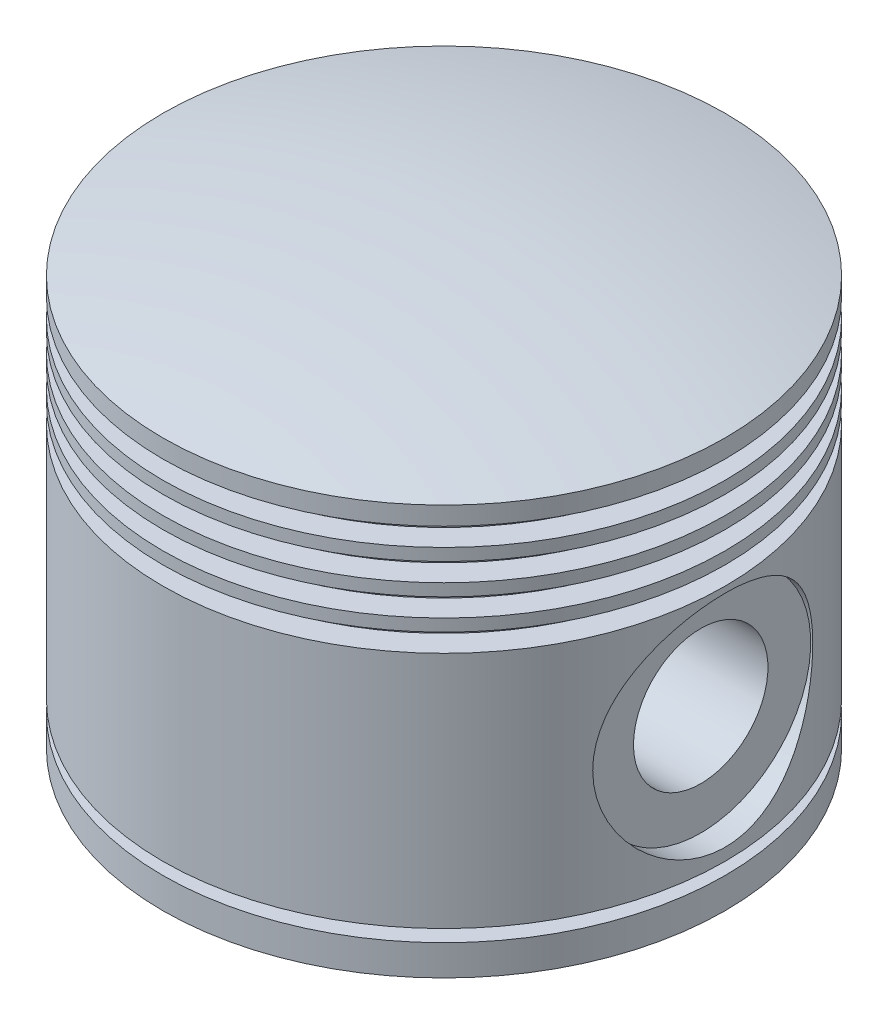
ISO-10303-21;
HEADER;
FILE_DESCRIPTION(('STEP AP214'),'2;1');
FILE_NAME('part.step','',(''),(''),'','','');
FILE_SCHEMA(('AUTOMOTIVE_DESIGN { 1 0 10303 214 1 1 1 1 }'));
ENDSEC;
DATA;
#1=APPLICATION_CONTEXT('core data for automotive mechanical design processes');
#2=APPLICATION_PROTOCOL_DEFINITION('international standard','automotive_design',2000,#1);
#3=PRODUCT_CONTEXT('',#1,'mechanical');
#4=PRODUCT('Part','Part','',(#3));
#5=PRODUCT_RELATED_PRODUCT_CATEGORY('part','',(#4));
#6=PRODUCT_DEFINITION_FORMATION('','',#4);
#7=PRODUCT_DEFINITION_CONTEXT('part definition',#1,'design');
#8=PRODUCT_DEFINITION('design','',#6,#7);
#9=PRODUCT_DEFINITION_SHAPE('','',#8);
#10=(LENGTH_UNIT() NAMED_UNIT(*) SI_UNIT(.MILLI.,.METRE.));
#11=(NAMED_UNIT(*) PLANE_ANGLE_UNIT() SI_UNIT($,.RADIAN.));
#12=(NAMED_UNIT(*) SI_UNIT($,.STERADIAN.) SOLID_ANGLE_UNIT());
#13=UNCERTAINTY_MEASURE_WITH_UNIT(LENGTH_MEASURE(1.E-05),#10,'distance_accuracy_value','');
#14=(GEOMETRIC_REPRESENTATION_CONTEXT(3) GLOBAL_UNCERTAINTY_ASSIGNED_CONTEXT((#13)) GLOBAL_UNIT_ASSIGNED_CONTEXT((#10,
#11,#12)) REPRESENTATION_CONTEXT('',''));
#15=CARTESIAN_POINT('',(0.,0.,0.));
#16=DIRECTION('',(0.,0.,1.));
#17=DIRECTION('',(1.,0.,0.));
#18=AXIS2_PLACEMENT_3D('',#15,#16,#17);
#19=CARTESIAN_POINT('',(0.,39.5920181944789,0.));
#20=DIRECTION('',(0.,1.,0.));
#21=DIRECTION('',(0.,0.,1.));
#22=AXIS2_PLACEMENT_3D('',#19,#20,#21);
#23=CYLINDRICAL_SURFACE('',#22,46.);
#24=CARTESIAN_POINT('',(46.,45.,0.));
#25=CARTESIAN_POINT('',(46.00000249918,45.0000033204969,0.485846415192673));
#26=CARTESIAN_POINT('',(45.9922867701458,44.9803149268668,0.971649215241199));
#27=CARTESIAN_POINT('',(45.9616412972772,44.9017820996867,1.93955551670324));
#28=CARTESIAN_POINT('',(45.9387133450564,44.8429422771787,2.42165944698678));
#29=CARTESIAN_POINT('',(45.8782670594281,44.6867339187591,3.3785223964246));
#30=CARTESIAN_POINT('',(45.8407521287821,44.5893743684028,3.85328310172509));
#31=CARTESIAN_POINT('',(45.7521248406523,44.3570862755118,4.79222951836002));
#32=CARTESIAN_POINT('',(45.7010120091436,44.2221564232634,5.25641486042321));
#33=CARTESIAN_POINT('',(45.5866348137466,43.9163037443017,6.1701129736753));
#34=CARTESIAN_POINT('',(45.523396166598,43.74545701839,6.6196544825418));
#35=CARTESIAN_POINT('',(45.3862923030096,43.3690633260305,7.50226260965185));
#36=CARTESIAN_POINT('',(45.3124271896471,43.16351669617,7.93532938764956));
#37=CARTESIAN_POINT('',(45.1558673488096,42.7192735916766,8.78255575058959));
#38=CARTESIAN_POINT('',(45.0731706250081,42.4805696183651,9.19671103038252));
#39=CARTESIAN_POINT('',(44.9009510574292,41.971730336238,10.003742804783));
#40=CARTESIAN_POINT('',(44.8114279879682,41.7015939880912,10.3966185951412));
#41=CARTESIAN_POINT('',(44.6239205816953,41.1199551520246,11.1746280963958));
#42=CARTESIAN_POINT('',(44.5257399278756,40.8072125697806,11.5587877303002));
#43=CARTESIAN_POINT('',(44.326754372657,40.1513805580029,12.2998429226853));
#44=CARTESIAN_POINT('',(44.2259482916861,39.8082773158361,12.6567259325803));
#45=CARTESIAN_POINT('',(44.0243212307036,39.0937320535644,13.3411572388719));
#46=CARTESIAN_POINT('',(43.9235002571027,38.7222805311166,13.6686956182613));
#47=CARTESIAN_POINT('',(43.7245803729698,37.9533900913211,14.2922407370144));
#48=CARTESIAN_POINT('',(43.626480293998,37.5559625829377,14.5882611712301));
#49=CARTESIAN_POINT('',(43.4315619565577,36.7197125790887,15.1589645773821));
#50=CARTESIAN_POINT('',(43.3349759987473,36.2798481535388,15.43220297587));
#51=CARTESIAN_POINT('',(43.1506070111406,35.3767672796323,15.9404591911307));
#52=CARTESIAN_POINT('',(43.0628242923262,34.9135500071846,16.1754756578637));
#53=CARTESIAN_POINT('',(42.8989648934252,33.9669472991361,16.6051710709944));
#54=CARTESIAN_POINT('',(42.8228841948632,33.483568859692,16.7998638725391));
#55=CARTESIAN_POINT('',(42.6850335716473,32.4999198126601,17.1470947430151));
#56=CARTESIAN_POINT('',(42.6232627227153,31.9996502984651,17.2996355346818));
#57=CARTESIAN_POINT('',(42.5186328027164,31.0082829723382,17.5551727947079));
#58=CARTESIAN_POINT('',(42.4750634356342,30.5177443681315,17.6600479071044));
#59=CARTESIAN_POINT('',(42.4045950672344,29.5284467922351,17.8285921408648));
#60=CARTESIAN_POINT('',(42.3776956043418,29.0296880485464,17.8922624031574));
#61=CARTESIAN_POINT('',(42.3415488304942,28.0281506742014,17.9776361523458));
#62=CARTESIAN_POINT('',(42.3322945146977,27.5253737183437,17.9993562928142));
#63=CARTESIAN_POINT('',(42.3317594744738,26.519768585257,18.0006154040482));
#64=CARTESIAN_POINT('',(42.3404779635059,26.0169404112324,17.9801562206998));
#65=CARTESIAN_POINT('',(42.3743977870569,25.0485656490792,17.9000590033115));
#66=CARTESIAN_POINT('',(42.3984698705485,24.5827544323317,17.8431039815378));
#67=CARTESIAN_POINT('',(42.4612326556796,23.6579823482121,17.6932279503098));
#68=CARTESIAN_POINT('',(42.499922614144,23.1990211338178,17.600308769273));
#69=CARTESIAN_POINT('',(42.5907392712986,22.2909412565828,17.3793890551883));
#70=CARTESIAN_POINT('',(42.6428675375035,21.8418237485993,17.2513844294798));
#71=CARTESIAN_POINT('',(42.7590222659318,20.9562665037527,16.9614379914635));
#72=CARTESIAN_POINT('',(42.823049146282,20.5198272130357,16.7994949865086));
#73=CARTESIAN_POINT('',(42.9625739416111,19.6536330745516,16.4394412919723));
#74=CARTESIAN_POINT('',(43.0382744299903,19.2241831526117,16.2406761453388));
#75=CARTESIAN_POINT('',(43.1980775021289,18.3834895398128,15.810713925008));
#76=CARTESIAN_POINT('',(43.2821801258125,17.9722459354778,15.579516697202));
#77=CARTESIAN_POINT('',(43.4565786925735,17.1700691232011,15.0862250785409));
#78=CARTESIAN_POINT('',(43.5468751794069,16.7791377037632,14.8241279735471));
#79=CARTESIAN_POINT('',(43.7314238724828,16.0194122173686,14.270519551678));
#80=CARTESIAN_POINT('',(43.8256778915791,15.6506284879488,13.9789946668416));
#81=CARTESIAN_POINT('',(44.0228396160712,14.9108844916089,13.3456924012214));
#82=CARTESIAN_POINT('',(44.125872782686,14.5417704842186,13.0017943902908));
#83=CARTESIAN_POINT('',(44.3309850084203,13.8337160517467,12.284255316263));
#84=CARTESIAN_POINT('',(44.4330644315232,13.4947636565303,11.9106261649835));
#85=CARTESIAN_POINT('',(44.6336321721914,12.8488366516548,11.1354918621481));
#86=CARTESIAN_POINT('',(44.7321189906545,12.5418752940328,10.7339752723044));
#87=CARTESIAN_POINT('',(44.9228338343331,11.9621831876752,9.90553620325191));
#88=CARTESIAN_POINT('',(45.0150618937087,11.6894522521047,9.4786138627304));
#89=CARTESIAN_POINT('',(45.1923878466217,11.1756154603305,8.59390882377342));
#90=CARTESIAN_POINT('',(45.2773247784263,10.935178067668,8.13570494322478));
#91=CARTESIAN_POINT('',(45.4357294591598,10.4940035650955,7.19862878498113));
#92=CARTESIAN_POINT('',(45.5091969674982,10.2932672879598,6.71975607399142));
#93=CARTESIAN_POINT('',(45.6424959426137,9.93350188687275,5.74494928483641));
#94=CARTESIAN_POINT('',(45.7023327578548,9.77445640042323,5.24902198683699));
#95=CARTESIAN_POINT('',(45.8066148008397,9.49965292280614,4.24373929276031));
#96=CARTESIAN_POINT('',(45.8510610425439,9.38389207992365,3.73438478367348));
#97=CARTESIAN_POINT('',(45.9211459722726,9.20229694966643,2.73576818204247));
#98=CARTESIAN_POINT('',(45.9477138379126,9.13398880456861,2.2470200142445));
#99=CARTESIAN_POINT('',(45.9852285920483,9.03772762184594,1.26497317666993));
#100=CARTESIAN_POINT('',(45.9961760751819,9.00977304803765,0.771674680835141));
#101=CARTESIAN_POINT('',(46.002142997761,8.99452287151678,-0.215538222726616));
#102=CARTESIAN_POINT('',(45.9971658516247,9.00721855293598,-0.709452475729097));
#103=CARTESIAN_POINT('',(45.9714303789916,9.07311145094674,-1.69415052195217));
#104=CARTESIAN_POINT('',(45.9506723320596,9.12630795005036,-2.1849343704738));
#105=CARTESIAN_POINT('',(45.8951679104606,9.26950155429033,-3.13879162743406));
#106=CARTESIAN_POINT('',(45.8610563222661,9.35783123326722,-3.60215375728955));
#107=CARTESIAN_POINT('',(45.7797649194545,9.57024099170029,-4.51941518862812));
#108=CARTESIAN_POINT('',(45.7325855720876,9.69431979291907,-4.9733148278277));
#109=CARTESIAN_POINT('',(45.626316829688,9.97713453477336,-5.86877685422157));
#110=CARTESIAN_POINT('',(45.5672264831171,10.1358732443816,-6.3103382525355));
#111=CARTESIAN_POINT('',(45.4385599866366,10.4866916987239,-7.17842851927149));
#112=CARTESIAN_POINT('',(45.3689834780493,10.6787725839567,-7.60495687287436));
#113=CARTESIAN_POINT('',(45.2187437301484,11.1011039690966,-8.45318261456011));
#114=CARTESIAN_POINT('',(45.1378091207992,11.3323320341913,-8.87434506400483));
#115=CARTESIAN_POINT('',(44.9685217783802,11.8269340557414,-9.69576887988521));
#116=CARTESIAN_POINT('',(44.8801689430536,12.0903084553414,-10.0960299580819));
#117=CARTESIAN_POINT('',(44.6981514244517,12.6475063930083,-10.8735794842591));
#118=CARTESIAN_POINT('',(44.6044858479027,12.9413350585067,-11.250864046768));
#119=CARTESIAN_POINT('',(44.4140576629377,13.5577360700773,-11.9805567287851));
#120=CARTESIAN_POINT('',(44.3172939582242,13.88031866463,-12.3329558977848));
#121=CARTESIAN_POINT('',(44.1168828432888,14.5735654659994,-13.0323130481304));
#122=CARTESIAN_POINT('',(44.0131862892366,14.9459791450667,-13.3775251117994));
#123=CARTESIAN_POINT('',(43.8077934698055,15.7189724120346,-14.0355286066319));
#124=CARTESIAN_POINT('',(43.7060973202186,16.1195536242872,-14.348318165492));
#125=CARTESIAN_POINT('',(43.5075599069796,16.9466935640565,-14.9395290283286));
#126=CARTESIAN_POINT('',(43.4107203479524,17.3732612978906,-15.2179383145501));
#127=CARTESIAN_POINT('',(43.2248421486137,18.2495602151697,-15.738148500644));
#128=CARTESIAN_POINT('',(43.1358003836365,18.6992820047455,-15.9799640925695));
#129=CARTESIAN_POINT('',(42.9675905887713,19.6229009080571,-16.4269189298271));
#130=CARTESIAN_POINT('',(42.8885058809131,20.0969605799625,-16.6317541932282));
#131=CARTESIAN_POINT('',(42.7436896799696,21.062754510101,-17.0004786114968));
#132=CARTESIAN_POINT('',(42.6779583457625,21.5544889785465,-17.1643672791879));
#133=CARTESIAN_POINT('',(42.5622158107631,22.551710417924,-17.4493974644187));
#134=CARTESIAN_POINT('',(42.5121954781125,23.0571892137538,-17.5705638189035));
#135=CARTESIAN_POINT('',(42.4296911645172,24.0781107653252,-17.7688744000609));
#136=CARTESIAN_POINT('',(42.3972058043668,24.5935527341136,-17.84602208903));
#137=CARTESIAN_POINT('',(42.3526204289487,25.5940565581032,-17.9515612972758));
#138=CARTESIAN_POINT('',(42.3392632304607,26.0787470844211,-17.9829622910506));
#139=CARTESIAN_POINT('',(42.3292693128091,27.0492420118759,-18.0064750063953));
#140=CARTESIAN_POINT('',(42.332631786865,27.5350463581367,-17.9985886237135));
#141=CARTESIAN_POINT('',(42.3559600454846,28.5039697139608,-17.9436207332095));
#142=CARTESIAN_POINT('',(42.3759240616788,28.9870890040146,-17.8965433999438));
#143=CARTESIAN_POINT('',(42.431773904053,29.947040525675,-17.7637197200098));
#144=CARTESIAN_POINT('',(42.4676596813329,30.4238727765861,-17.6779734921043));
#145=CARTESIAN_POINT('',(42.5525896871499,31.3506425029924,-17.4725203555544));
#146=CARTESIAN_POINT('',(42.6011088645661,31.8009278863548,-17.3541594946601));
#147=CARTESIAN_POINT('',(42.710386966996,32.6896069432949,-17.0834460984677));
#148=CARTESIAN_POINT('',(42.7711454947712,33.1280010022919,-16.9310946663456));
#149=CARTESIAN_POINT('',(42.9031882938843,33.9903628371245,-16.5936503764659));
#150=CARTESIAN_POINT('',(42.9744729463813,34.41433008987,-16.4085563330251));
#151=CARTESIAN_POINT('',(43.1256767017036,35.2456753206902,-16.0069373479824));
#152=CARTESIAN_POINT('',(43.2055989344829,35.6530472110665,-15.7904010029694));
#153=CARTESIAN_POINT('',(43.3766338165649,36.4710664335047,-15.3145367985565));
#154=CARTESIAN_POINT('',(43.4681212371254,36.8806428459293,-15.0535019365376));
#155=CARTESIAN_POINT('',(43.6559406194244,37.6766467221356,-14.4998032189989));
#156=CARTESIAN_POINT('',(43.7522727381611,38.0630734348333,-14.2071383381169));
#157=CARTESIAN_POINT('',(43.9473220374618,38.8109057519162,-13.5918018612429));
#158=CARTESIAN_POINT('',(44.0460402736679,39.1722999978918,-13.2691167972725));
#159=CARTESIAN_POINT('',(44.2433012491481,39.8678243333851,-12.5957662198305));
#160=CARTESIAN_POINT('',(44.3418440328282,40.201962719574,-12.2451092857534));
#161=CARTESIAN_POINT('',(44.5423168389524,40.8608236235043,-11.4952881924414));
#162=CARTESIAN_POINT('',(44.6440844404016,41.1837147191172,-11.0944683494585));
#163=CARTESIAN_POINT('',(44.8419063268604,41.7945968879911,-10.265715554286));
#164=CARTESIAN_POINT('',(44.9379604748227,42.0825871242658,-9.83778195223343));
#165=CARTESIAN_POINT('',(45.1217097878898,42.6215527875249,-8.95731826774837));
#166=CARTESIAN_POINT('',(45.2094027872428,42.872518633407,-8.50478185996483));
#167=CARTESIAN_POINT('',(45.3739241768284,43.335230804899,-7.57815556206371));
#168=CARTESIAN_POINT('',(45.4507520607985,43.5469753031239,-7.1040646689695));
#169=CARTESIAN_POINT('',(45.5970207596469,43.9447722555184,-6.09838250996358));
#170=CARTESIAN_POINT('',(45.6653561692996,44.1273453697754,-5.56524713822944));
#171=CARTESIAN_POINT('',(45.7843378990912,44.4420998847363,-4.48231250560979));
#172=CARTESIAN_POINT('',(45.8349826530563,44.5742768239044,-3.93251177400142));
#173=CARTESIAN_POINT('',(45.9167446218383,44.7864281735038,-2.82178627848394));
#174=CARTESIAN_POINT('',(45.9478721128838,44.8664300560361,-2.26086752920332));
#175=CARTESIAN_POINT('',(45.9894966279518,44.9732096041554,-1.13327876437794));
#176=CARTESIAN_POINT('',(45.9999970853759,44.9999961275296,-0.566609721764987));
#177=CARTESIAN_POINT('',(46.,45.,0.));
#178=B_SPLINE_CURVE_WITH_KNOTS('',3,(#24,#25,#26,#27,#28,#29,#30,#31,#32,#33,#34,#35,#36,#37,
#38,#39,#40,#41,#42,#43,#44,#45,#46,#47,#48,#49,#50,#51,#52,#53,#54,#55,#56,#57,#58,#59,#60,#61,
#62,#63,#64,#65,#66,#67,#68,#69,#70,#71,#72,#73,#74,#75,#76,#77,#78,#79,#80,#81,#82,#83,#84,#85,
#86,#87,#88,#89,#90,#91,#92,#93,#94,#95,#96,#97,#98,#99,#100,#101,#102,#103,#104,#105,#106,#107,
#108,#109,#110,#111,#112,#113,#114,#115,#116,#117,#118,#119,#120,#121,#122,#123,#124,#125,#126,
#127,#128,#129,#130,#131,#132,#133,#134,#135,#136,#137,#138,#139,#140,#141,#142,#143,#144,#145,
#146,#147,#148,#149,#150,#151,#152,#153,#154,#155,#156,#157,#158,#159,#160,#161,#162,#163,#164,
#165,#166,#167,#168,#169,#170,#171,#172,#173,#174,#175,#176,#177),.UNSPECIFIED.,.T.,.F.,(4,2,2,
2,2,2,2,2,2,2,2,2,2,2,2,2,2,2,2,2,2,2,2,2,2,2,2,2,2,2,2,2,2,2,2,2,2,2,2,2,2,2,2,2,2,2,2,2,2,2,2,
2,2,2,2,2,2,2,2,2,2,2,2,2,2,2,2,2,2,2,2,2,2,2,2,2,4),(0.,1.45700633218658,2.9138410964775,
4.37033622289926,5.82688212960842,7.28037245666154,8.73384868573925,10.1876541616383,
11.6415077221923,13.1548318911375,14.6688481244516,16.1833741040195,17.6972392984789,
19.2755428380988,20.8539021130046,22.4317181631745,24.0094322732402,25.517988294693,
27.0265025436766,28.5344178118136,30.0422670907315,31.4503071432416,32.8582756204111,
34.2664084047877,35.6745906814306,37.1107413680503,38.5468988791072,39.9831826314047,
41.4201316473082,42.9630815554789,44.5054163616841,46.0483875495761,47.5913503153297,
49.1624895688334,50.7336617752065,52.3042164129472,53.8746675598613,55.3554254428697,
56.8361269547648,58.3165110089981,59.7968688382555,61.2140494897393,62.6311794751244,
64.0484227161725,65.4657144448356,66.925809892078,68.3859254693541,69.8462872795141,
71.307171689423,72.860222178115,74.4133623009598,75.9670438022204,77.5200998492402,
79.085392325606,80.650703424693,82.2151030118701,83.7793795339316,85.2352034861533,
86.6909571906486,88.1465558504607,89.6021500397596,91.0048957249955,92.4075958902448,
93.8103468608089,95.2136078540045,96.6946795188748,98.1757992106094,99.6575866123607,
101.138921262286,102.711021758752,104.283159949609,105.855704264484,107.428321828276,
109.128557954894,110.828944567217,112.528435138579,114.22764280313),.UNSPECIFIED.);
#179=CARTESIAN_POINT('',(46.,45.,0.));
#180=VERTEX_POINT('',#179);
#181=EDGE_CURVE('E44',#180,#180,#178,.T.);
#182=ORIENTED_EDGE('',*,*,#181,.F.);
#183=EDGE_LOOP('',(#182));
#184=FACE_BOUND('',#183,.T.);
#185=CARTESIAN_POINT('',(0.,46.,0.));
#186=DIRECTION('',(0.,1.,0.));
#187=DIRECTION('',(0.,0.,1.));
#188=AXIS2_PLACEMENT_3D('',#185,#186,#187);
#189=CIRCLE('',#188,46.);
#190=CARTESIAN_POINT('',(0.,46.,46.));
#191=VERTEX_POINT('',#190);
#192=EDGE_CURVE('E247',#191,#191,#189,.T.);
#193=ORIENTED_EDGE('',*,*,#192,.F.);
#194=EDGE_LOOP('',(#193));
#195=FACE_BOUND('',#194,.T.);
#196=CARTESIAN_POINT('',(0.,7.,0.));
#197=DIRECTION('',(0.,1.,0.));
#198=DIRECTION('',(0.,0.,1.));
#199=AXIS2_PLACEMENT_3D('',#196,#197,#198);
#200=CIRCLE('',#199,46.);
#201=CARTESIAN_POINT('',(0.,7.,46.));
#202=VERTEX_POINT('',#201);
#203=EDGE_CURVE('E250',#202,#202,#200,.T.);
#204=ORIENTED_EDGE('',*,*,#203,.T.);
#205=EDGE_LOOP('',(#204));
#206=FACE_BOUND('',#205,.T.);
#207=CARTESIAN_POINT('',(-46.,45.,0.));
#208=CARTESIAN_POINT('',(-46.00000249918,45.0000033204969,-0.485846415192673));
#209=CARTESIAN_POINT('',(-45.9922867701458,44.9803149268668,-0.971649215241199));
#210=CARTESIAN_POINT('',(-45.9616412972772,44.9017820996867,-1.93955551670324));
#211=CARTESIAN_POINT('',(-45.9387133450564,44.8429422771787,-2.42165944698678));
#212=CARTESIAN_POINT('',(-45.8782670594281,44.6867339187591,-3.3785223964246));
#213=CARTESIAN_POINT('',(-45.8407521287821,44.5893743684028,-3.85328310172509));
#214=CARTESIAN_POINT('',(-45.7521248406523,44.3570862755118,-4.79222951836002));
#215=CARTESIAN_POINT('',(-45.7010120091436,44.2221564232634,-5.25641486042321));
#216=CARTESIAN_POINT('',(-45.5866348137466,43.9163037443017,-6.1701129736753));
#217=CARTESIAN_POINT('',(-45.523396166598,43.74545701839,-6.6196544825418));
#218=CARTESIAN_POINT('',(-45.3862923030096,43.3690633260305,-7.50226260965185));
#219=CARTESIAN_POINT('',(-45.3124271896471,43.16351669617,-7.93532938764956));
#220=CARTESIAN_POINT('',(-45.1558673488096,42.7192735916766,-8.78255575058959));
#221=CARTESIAN_POINT('',(-45.0731706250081,42.4805696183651,-9.19671103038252));
#222=CARTESIAN_POINT('',(-44.9009510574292,41.971730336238,-10.003742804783));
#223=CARTESIAN_POINT('',(-44.8114279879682,41.7015939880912,-10.3966185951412));
#224=CARTESIAN_POINT('',(-44.6239205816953,41.1199551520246,-11.1746280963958));
#225=CARTESIAN_POINT('',(-44.5257399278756,40.8072125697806,-11.5587877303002));
#226=CARTESIAN_POINT('',(-44.326754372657,40.1513805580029,-12.2998429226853));
#227=CARTESIAN_POINT('',(-44.2259482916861,39.8082773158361,-12.6567259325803));
#228=CARTESIAN_POINT('',(-44.0243212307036,39.0937320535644,-13.3411572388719));
#229=CARTESIAN_POINT('',(-43.9235002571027,38.7222805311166,-13.6686956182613));
#230=CARTESIAN_POINT('',(-43.7245803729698,37.9533900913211,-14.2922407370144));
#231=CARTESIAN_POINT('',(-43.626480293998,37.5559625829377,-14.5882611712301));
#232=CARTESIAN_POINT('',(-43.4315619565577,36.7197125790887,-15.1589645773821));
#233=CARTESIAN_POINT('',(-43.3349759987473,36.2798481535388,-15.43220297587));
#234=CARTESIAN_POINT('',(-43.1506070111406,35.3767672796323,-15.9404591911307));
#235=CARTESIAN_POINT('',(-43.0628242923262,34.9135500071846,-16.1754756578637));
#236=CARTESIAN_POINT('',(-42.8989648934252,33.9669472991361,-16.6051710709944));
#237=CARTESIAN_POINT('',(-42.8228841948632,33.483568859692,-16.7998638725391));
#238=CARTESIAN_POINT('',(-42.6850335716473,32.4999198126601,-17.1470947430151));
#239=CARTESIAN_POINT('',(-42.6232627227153,31.9996502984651,-17.2996355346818));
#240=CARTESIAN_POINT('',(-42.5186328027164,31.0082829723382,-17.5551727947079));
#241=CARTESIAN_POINT('',(-42.4750634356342,30.5177443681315,-17.6600479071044));
#242=CARTESIAN_POINT('',(-42.4045950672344,29.5284467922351,-17.8285921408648));
#243=CARTESIAN_POINT('',(-42.3776956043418,29.0296880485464,-17.8922624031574));
#244=CARTESIAN_POINT('',(-42.3415488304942,28.0281506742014,-17.9776361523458));
#245=CARTESIAN_POINT('',(-42.3322945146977,27.5253737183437,-17.9993562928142));
#246=CARTESIAN_POINT('',(-42.3317594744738,26.519768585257,-18.0006154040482));
#247=CARTESIAN_POINT('',(-42.3404779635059,26.0169404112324,-17.9801562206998));
#248=CARTESIAN_POINT('',(-42.3743977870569,25.0485656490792,-17.9000590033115));
#249=CARTESIAN_POINT('',(-42.3984698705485,24.5827544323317,-17.8431039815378));
#250=CARTESIAN_POINT('',(-42.4612326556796,23.6579823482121,-17.6932279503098));
#251=CARTESIAN_POINT('',(-42.499922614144,23.1990211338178,-17.600308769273));
#252=CARTESIAN_POINT('',(-42.5907392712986,22.2909412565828,-17.3793890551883));
#253=CARTESIAN_POINT('',(-42.6428675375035,21.8418237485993,-17.2513844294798));
#254=CARTESIAN_POINT('',(-42.7590222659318,20.9562665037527,-16.9614379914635));
#255=CARTESIAN_POINT('',(-42.823049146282,20.5198272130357,-16.7994949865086));
#256=CARTESIAN_POINT('',(-42.9625739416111,19.6536330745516,-16.4394412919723));
#257=CARTESIAN_POINT('',(-43.0382744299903,19.2241831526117,-16.2406761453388));
#258=CARTESIAN_POINT('',(-43.1980775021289,18.3834895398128,-15.810713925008));
#259=CARTESIAN_POINT('',(-43.2821801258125,17.9722459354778,-15.579516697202));
#260=CARTESIAN_POINT('',(-43.4565786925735,17.1700691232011,-15.0862250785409));
#261=CARTESIAN_POINT('',(-43.5468751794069,16.7791377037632,-14.8241279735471));
#262=CARTESIAN_POINT('',(-43.7314238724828,16.0194122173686,-14.270519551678));
#263=CARTESIAN_POINT('',(-43.8256778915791,15.6506284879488,-13.9789946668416));
#264=CARTESIAN_POINT('',(-44.0228396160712,14.9108844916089,-13.3456924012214));
#265=CARTESIAN_POINT('',(-44.125872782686,14.5417704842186,-13.0017943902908));
#266=CARTESIAN_POINT('',(-44.3309850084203,13.8337160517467,-12.284255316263));
#267=CARTESIAN_POINT('',(-44.4330644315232,13.4947636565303,-11.9106261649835));
#268=CARTESIAN_POINT('',(-44.6336321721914,12.8488366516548,-11.1354918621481));
#269=CARTESIAN_POINT('',(-44.7321189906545,12.5418752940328,-10.7339752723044));
#270=CARTESIAN_POINT('',(-44.9228338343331,11.9621831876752,-9.90553620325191));
#271=CARTESIAN_POINT('',(-45.0150618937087,11.6894522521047,-9.4786138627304));
#272=CARTESIAN_POINT('',(-45.1923878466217,11.1756154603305,-8.59390882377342));
#273=CARTESIAN_POINT('',(-45.2773247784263,10.935178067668,-8.13570494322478));
#274=CARTESIAN_POINT('',(-45.4357294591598,10.4940035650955,-7.19862878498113));
#275=CARTESIAN_POINT('',(-45.5091969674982,10.2932672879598,-6.71975607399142));
#276=CARTESIAN_POINT('',(-45.6424959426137,9.93350188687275,-5.74494928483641));
#277=CARTESIAN_POINT('',(-45.7023327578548,9.77445640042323,-5.24902198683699));
#278=CARTESIAN_POINT('',(-45.8066148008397,9.49965292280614,-4.24373929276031));
#279=CARTESIAN_POINT('',(-45.8510610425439,9.38389207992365,-3.73438478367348));
#280=CARTESIAN_POINT('',(-45.9211459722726,9.20229694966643,-2.73576818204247));
#281=CARTESIAN_POINT('',(-45.9477138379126,9.13398880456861,-2.2470200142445));
#282=CARTESIAN_POINT('',(-45.9852285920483,9.03772762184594,-1.26497317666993));
#283=CARTESIAN_POINT('',(-45.9961760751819,9.00977304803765,-0.771674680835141));
#284=CARTESIAN_POINT('',(-46.002142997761,8.99452287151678,0.215538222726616));
#285=CARTESIAN_POINT('',(-45.9971658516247,9.00721855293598,0.709452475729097));
#286=CARTESIAN_POINT('',(-45.9714303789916,9.07311145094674,1.69415052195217));
#287=CARTESIAN_POINT('',(-45.9506723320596,9.12630795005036,2.1849343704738));
#288=CARTESIAN_POINT('',(-45.8951679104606,9.26950155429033,3.13879162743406));
#289=CARTESIAN_POINT('',(-45.8610563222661,9.35783123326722,3.60215375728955));
#290=CARTESIAN_POINT('',(-45.7797649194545,9.57024099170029,4.51941518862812));
#291=CARTESIAN_POINT('',(-45.7325855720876,9.69431979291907,4.9733148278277));
#292=CARTESIAN_POINT('',(-45.626316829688,9.97713453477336,5.86877685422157));
#293=CARTESIAN_POINT('',(-45.5672264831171,10.1358732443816,6.3103382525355));
#294=CARTESIAN_POINT('',(-45.4385599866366,10.4866916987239,7.17842851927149));
#295=CARTESIAN_POINT('',(-45.3689834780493,10.6787725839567,7.60495687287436));
#296=CARTESIAN_POINT('',(-45.2187437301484,11.1011039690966,8.45318261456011));
#297=CARTESIAN_POINT('',(-45.1378091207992,11.3323320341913,8.87434506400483));
#298=CARTESIAN_POINT('',(-44.9685217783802,11.8269340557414,9.69576887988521));
#299=CARTESIAN_POINT('',(-44.8801689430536,12.0903084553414,10.0960299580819));
#300=CARTESIAN_POINT('',(-44.6981514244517,12.6475063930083,10.8735794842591));
#301=CARTESIAN_POINT('',(-44.6044858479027,12.9413350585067,11.250864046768));
#302=CARTESIAN_POINT('',(-44.4140576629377,13.5577360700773,11.9805567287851));
#303=CARTESIAN_POINT('',(-44.3172939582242,13.88031866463,12.3329558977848));
#304=CARTESIAN_POINT('',(-44.1168828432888,14.5735654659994,13.0323130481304));
#305=CARTESIAN_POINT('',(-44.0131862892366,14.9459791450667,13.3775251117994));
#306=CARTESIAN_POINT('',(-43.8077934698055,15.7189724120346,14.0355286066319));
#307=CARTESIAN_POINT('',(-43.7060973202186,16.1195536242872,14.348318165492));
#308=CARTESIAN_POINT('',(-43.5075599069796,16.9466935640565,14.9395290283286));
#309=CARTESIAN_POINT('',(-43.4107203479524,17.3732612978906,15.2179383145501));
#310=CARTESIAN_POINT('',(-43.2248421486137,18.2495602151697,15.738148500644));
#311=CARTESIAN_POINT('',(-43.1358003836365,18.6992820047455,15.9799640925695));
#312=CARTESIAN_POINT('',(-42.9675905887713,19.6229009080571,16.4269189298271));
#313=CARTESIAN_POINT('',(-42.8885058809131,20.0969605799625,16.6317541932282));
#314=CARTESIAN_POINT('',(-42.7436896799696,21.062754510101,17.0004786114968));
#315=CARTESIAN_POINT('',(-42.6779583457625,21.5544889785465,17.1643672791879));
#316=CARTESIAN_POINT('',(-42.5622158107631,22.551710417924,17.4493974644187));
#317=CARTESIAN_POINT('',(-42.5121954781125,23.0571892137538,17.5705638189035));
#318=CARTESIAN_POINT('',(-42.4296911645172,24.0781107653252,17.7688744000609));
#319=CARTESIAN_POINT('',(-42.3972058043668,24.5935527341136,17.84602208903));
#320=CARTESIAN_POINT('',(-42.3526204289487,25.5940565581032,17.9515612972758));
#321=CARTESIAN_POINT('',(-42.3392632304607,26.0787470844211,17.9829622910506));
#322=CARTESIAN_POINT('',(-42.3292693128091,27.0492420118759,18.0064750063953));
#323=CARTESIAN_POINT('',(-42.332631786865,27.5350463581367,17.9985886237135));
#324=CARTESIAN_POINT('',(-42.3559600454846,28.5039697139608,17.9436207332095));
#325=CARTESIAN_POINT('',(-42.3759240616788,28.9870890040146,17.8965433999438));
#326=CARTESIAN_POINT('',(-42.431773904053,29.947040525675,17.7637197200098));
#327=CARTESIAN_POINT('',(-42.4676596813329,30.4238727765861,17.6779734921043));
#328=CARTESIAN_POINT('',(-42.5525896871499,31.3506425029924,17.4725203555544));
#329=CARTESIAN_POINT('',(-42.6011088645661,31.8009278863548,17.3541594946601));
#330=CARTESIAN_POINT('',(-42.710386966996,32.6896069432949,17.0834460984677));
#331=CARTESIAN_POINT('',(-42.7711454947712,33.1280010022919,16.9310946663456));
#332=CARTESIAN_POINT('',(-42.9031882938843,33.9903628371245,16.5936503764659));
#333=CARTESIAN_POINT('',(-42.9744729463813,34.41433008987,16.4085563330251));
#334=CARTESIAN_POINT('',(-43.1256767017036,35.2456753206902,16.0069373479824));
#335=CARTESIAN_POINT('',(-43.2055989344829,35.6530472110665,15.7904010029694));
#336=CARTESIAN_POINT('',(-43.3766338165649,36.4710664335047,15.3145367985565));
#337=CARTESIAN_POINT('',(-43.4681212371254,36.8806428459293,15.0535019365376));
#338=CARTESIAN_POINT('',(-43.6559406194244,37.6766467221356,14.4998032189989));
#339=CARTESIAN_POINT('',(-43.7522727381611,38.0630734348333,14.2071383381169));
#340=CARTESIAN_POINT('',(-43.9473220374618,38.8109057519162,13.5918018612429));
#341=CARTESIAN_POINT('',(-44.0460402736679,39.1722999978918,13.2691167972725));
#342=CARTESIAN_POINT('',(-44.2433012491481,39.8678243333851,12.5957662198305));
#343=CARTESIAN_POINT('',(-44.3418440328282,40.201962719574,12.2451092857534));
#344=CARTESIAN_POINT('',(-44.5423168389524,40.8608236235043,11.4952881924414));
#345=CARTESIAN_POINT('',(-44.6440844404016,41.1837147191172,11.0944683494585));
#346=CARTESIAN_POINT('',(-44.8419063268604,41.7945968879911,10.265715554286));
#347=CARTESIAN_POINT('',(-44.9379604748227,42.0825871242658,9.83778195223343));
#348=CARTESIAN_POINT('',(-45.1217097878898,42.6215527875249,8.95731826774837));
#349=CARTESIAN_POINT('',(-45.2094027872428,42.872518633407,8.50478185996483));
#350=CARTESIAN_POINT('',(-45.3739241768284,43.335230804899,7.57815556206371));
#351=CARTESIAN_POINT('',(-45.4507520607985,43.5469753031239,7.1040646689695));
#352=CARTESIAN_POINT('',(-45.5970207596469,43.9447722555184,6.09838250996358));
#353=CARTESIAN_POINT('',(-45.6653561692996,44.1273453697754,5.56524713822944));
#354=CARTESIAN_POINT('',(-45.7843378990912,44.4420998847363,4.48231250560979));
#355=CARTESIAN_POINT('',(-45.8349826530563,44.5742768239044,3.93251177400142));
#356=CARTESIAN_POINT('',(-45.9167446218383,44.7864281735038,2.82178627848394));
#357=CARTESIAN_POINT('',(-45.9478721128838,44.8664300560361,2.26086752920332));
#358=CARTESIAN_POINT('',(-45.9894966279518,44.9732096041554,1.13327876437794));
#359=CARTESIAN_POINT('',(-45.9999970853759,44.9999961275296,0.566609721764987));
#360=CARTESIAN_POINT('',(-46.,45.,0.));
#361=B_SPLINE_CURVE_WITH_KNOTS('',3,(#207,#208,#209,#210,#211,#212,#213,#214,#215,#216,#217,
#218,#219,#220,#221,#222,#223,#224,#225,#226,#227,#228,#229,#230,#231,#232,#233,#234,#235,#236,
#237,#238,#239,#240,#241,#242,#243,#244,#245,#246,#247,#248,#249,#250,#251,#252,#253,#254,#255,
#256,#257,#258,#259,#260,#261,#262,#263,#264,#265,#266,#267,#268,#269,#270,#271,#272,#273,#274,
#275,#276,#277,#278,#279,#280,#281,#282,#283,#284,#285,#286,#287,#288,#289,#290,#291,#292,#293,
#294,#295,#296,#297,#298,#299,#300,#301,#302,#303,#304,#305,#306,#307,#308,#309,#310,#311,#312,
#313,#314,#315,#316,#317,#318,#319,#320,#321,#322,#323,#324,#325,#326,#327,#328,#329,#330,#331,
#332,#333,#334,#335,#336,#337,#338,#339,#340,#341,#342,#343,#344,#345,#346,#347,#348,#349,#350,
#351,#352,#353,#354,#355,#356,#357,#358,#359,#360),.UNSPECIFIED.,.T.,.F.,(4,2,2,2,2,2,2,2,2,2,2,
2,2,2,2,2,2,2,2,2,2,2,2,2,2,2,2,2,2,2,2,2,2,2,2,2,2,2,2,2,2,2,2,2,2,2,2,2,2,2,2,2,2,2,2,2,2,2,2,
2,2,2,2,2,2,2,2,2,2,2,2,2,2,2,2,2,4),(0.,1.45700633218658,2.9138410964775,4.37033622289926,
5.82688212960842,7.28037245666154,8.73384868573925,10.1876541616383,11.6415077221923,
13.1548318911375,14.6688481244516,16.1833741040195,17.6972392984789,19.2755428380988,
20.8539021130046,22.4317181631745,24.0094322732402,25.517988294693,27.0265025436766,
28.5344178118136,30.0422670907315,31.4503071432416,32.8582756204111,34.2664084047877,
35.6745906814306,37.1107413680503,38.5468988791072,39.9831826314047,41.4201316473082,
42.9630815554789,44.5054163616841,46.0483875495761,47.5913503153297,49.1624895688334,
50.7336617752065,52.3042164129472,53.8746675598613,55.3554254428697,56.8361269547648,
58.3165110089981,59.7968688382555,61.2140494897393,62.6311794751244,64.0484227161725,
65.4657144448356,66.925809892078,68.3859254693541,69.8462872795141,71.307171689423,
72.860222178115,74.4133623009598,75.9670438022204,77.5200998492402,79.085392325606,
80.650703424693,82.2151030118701,83.7793795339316,85.2352034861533,86.6909571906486,
88.1465558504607,89.6021500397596,91.0048957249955,92.4075958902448,93.8103468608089,
95.2136078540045,96.6946795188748,98.1757992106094,99.6575866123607,101.138921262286,
102.711021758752,104.283159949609,105.855704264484,107.428321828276,109.128557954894,
110.828944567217,112.528435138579,114.22764280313),.UNSPECIFIED.);
#362=CARTESIAN_POINT('',(-46.,45.,0.));
#363=VERTEX_POINT('',#362);
#364=EDGE_CURVE('E11',#363,#363,#361,.T.);
#365=ORIENTED_EDGE('',*,*,#364,.F.);
#366=EDGE_LOOP('',(#365));
#367=FACE_BOUND('',#366,.T.);
#368=ADVANCED_FACE('F32',(#184,#195,#206,#367),#23,.T.);
#369=CARTESIAN_POINT('',(-25.,27.,0.));
#370=DIRECTION('',(-1.,0.,0.));
#371=DIRECTION('',(0.,0.,-1.));
#372=AXIS2_PLACEMENT_3D('',#369,#370,#371);
#373=PLANE('',#372);
#374=CARTESIAN_POINT('',(-25.,27.,0.));
#375=DIRECTION('',(1.,0.,0.));
#376=DIRECTION('',(0.,0.,-1.));
#377=AXIS2_PLACEMENT_3D('',#374,#375,#376);
#378=CIRCLE('',#377,19.25);
#379=CARTESIAN_POINT('',(-25.,27.,-19.25));
#380=VERTEX_POINT('',#379);
#381=EDGE_CURVE('E394',#380,#380,#378,.T.);
#382=ORIENTED_EDGE('',*,*,#381,.T.);
#383=EDGE_LOOP('',(#382));
#384=FACE_BOUND('',#383,.T.);
#385=CARTESIAN_POINT('',(-25.,27.,0.));
#386=DIRECTION('',(-1.,0.,0.));
#387=DIRECTION('',(0.,0.,1.));
#388=AXIS2_PLACEMENT_3D('',#385,#386,#387);
#389=CIRCLE('',#388,11.);
#390=CARTESIAN_POINT('',(-25.,27.,11.));
#391=VERTEX_POINT('',#390);
#392=EDGE_CURVE('E405',#391,#391,#389,.T.);
#393=ORIENTED_EDGE('',*,*,#392,.T.);
#394=EDGE_LOOP('',(#393));
#395=FACE_BOUND('',#394,.T.);
#396=ADVANCED_FACE('F283',(#384,#395),#373,.F.);
#397=CARTESIAN_POINT('',(37.,42.,0.));
#398=DIRECTION('',(0.,1.,0.));
#399=DIRECTION('',(0.,0.,1.));
#400=AXIS2_PLACEMENT_3D('',#397,#398,#399);
#401=PLANE('',#400);
#402=CARTESIAN_POINT('',(0.,42.,0.));
#403=DIRECTION('',(0.,1.,0.));
#404=DIRECTION('',(0.,0.,1.));
#405=AXIS2_PLACEMENT_3D('',#402,#403,#404);
#406=CIRCLE('',#405,38.5);
#407=CARTESIAN_POINT('',(-36.5607371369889,42.,12.0649285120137));
#408=VERTEX_POINT('',#407);
#409=CARTESIAN_POINT('',(36.5607371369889,42.,12.0649285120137));
#410=VERTEX_POINT('',#409);
#411=EDGE_CURVE('E130',#408,#410,#406,.T.);
#412=ORIENTED_EDGE('',*,*,#411,.F.);
#413=DIRECTION('',(1.,0.,0.));
#414=VECTOR('',#413,1.);
#415=CARTESIAN_POINT('',(-500000.,42.,12.0649285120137));
#416=LINE('',#415,#414);
#417=CARTESIAN_POINT('',(-34.9776714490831,42.,12.0649285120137));
#418=VERTEX_POINT('',#417);
#419=EDGE_CURVE('E395',#418,#408,#416,.F.);
#420=ORIENTED_EDGE('',*,*,#419,.F.);
#421=CARTESIAN_POINT('',(0.,42.,0.));
#422=DIRECTION('',(0.,1.,0.));
#423=DIRECTION('',(0.,0.,1.));
#424=AXIS2_PLACEMENT_3D('',#421,#422,#423);
#425=CIRCLE('',#424,37.);
#426=CARTESIAN_POINT('',(34.9776714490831,42.,12.0649285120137));
#427=VERTEX_POINT('',#426);
#428=EDGE_CURVE('E134',#418,#427,#425,.T.);
#429=ORIENTED_EDGE('',*,*,#428,.T.);
#430=DIRECTION('',(-1.,0.,0.));
#431=VECTOR('',#430,1.);
#432=CARTESIAN_POINT('',(500000.,42.,12.0649285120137));
#433=LINE('',#432,#431);
#434=EDGE_CURVE('E189',#427,#410,#433,.F.);
#435=ORIENTED_EDGE('',*,*,#434,.T.);
#436=EDGE_LOOP('',(#412,#420,#429,#435));
#437=FACE_BOUND('',#436,.T.);
#438=ADVANCED_FACE('F288',(#437),#401,.F.);
#439=CARTESIAN_POINT('',(0.,39.5920181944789,0.));
#440=DIRECTION('',(0.,1.,0.));
#441=DIRECTION('',(0.,0.,1.));
#442=AXIS2_PLACEMENT_3D('',#439,#440,#441);
#443=CYLINDRICAL_SURFACE('',#442,38.5);
#444=CARTESIAN_POINT('',(0.,12.,0.));
#445=DIRECTION('',(0.,1.,0.));
#446=DIRECTION('',(0.,0.,1.));
#447=AXIS2_PLACEMENT_3D('',#444,#445,#446);
#448=CIRCLE('',#447,38.5);
#449=CARTESIAN_POINT('',(-36.5607371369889,12.,12.0649285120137));
#450=VERTEX_POINT('',#449);
#451=CARTESIAN_POINT('',(36.5607371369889,12.,12.0649285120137));
#452=VERTEX_POINT('',#451);
#453=EDGE_CURVE('E122',#450,#452,#448,.T.);
#454=ORIENTED_EDGE('',*,*,#453,.F.);
#455=CARTESIAN_POINT('',(-36.5607371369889,42.,12.0649285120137));
#456=CARTESIAN_POINT('',(-36.4197324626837,41.6562305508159,12.4923128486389));
#457=CARTESIAN_POINT('',(-36.2754378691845,41.2947870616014,12.9042974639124));
#458=CARTESIAN_POINT('',(-35.9841524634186,40.5386172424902,13.6955447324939));
#459=CARTESIAN_POINT('',(-35.8371614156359,40.143887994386,14.0748045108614));
#460=CARTESIAN_POINT('',(-35.5436447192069,39.3211760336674,14.8004534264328));
#461=CARTESIAN_POINT('',(-35.3971252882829,38.893033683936,15.1466646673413));
#462=CARTESIAN_POINT('',(-35.1814520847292,38.2290204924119,15.63801278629));
#463=CARTESIAN_POINT('',(-35.1102436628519,38.0040437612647,15.7971375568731));
#464=CARTESIAN_POINT('',(-34.9696892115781,37.5469885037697,16.105887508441));
#465=CARTESIAN_POINT('',(-34.9003437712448,37.3149077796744,16.2555097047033));
#466=CARTESIAN_POINT('',(-34.6957114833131,36.6077423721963,16.6901247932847));
#467=CARTESIAN_POINT('',(-34.5640511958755,36.1224111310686,16.9603649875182));
#468=CARTESIAN_POINT('',(-34.3148415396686,35.127280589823,17.4590791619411));
#469=CARTESIAN_POINT('',(-34.1972905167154,34.6174841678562,17.687558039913));
#470=CARTESIAN_POINT('',(-34.0348885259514,33.8374498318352,17.9969404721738));
#471=CARTESIAN_POINT('',(-33.9831165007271,33.5751299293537,18.0944376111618));
#472=CARTESIAN_POINT('',(-33.8846631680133,33.045706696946,18.2781411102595));
#473=CARTESIAN_POINT('',(-33.8379806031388,32.7786045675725,18.3643502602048));
#474=CARTESIAN_POINT('',(-33.7062897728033,31.9707463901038,18.6056395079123));
#475=CARTESIAN_POINT('',(-33.6296091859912,31.4233004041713,18.7434363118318));
#476=CARTESIAN_POINT('',(-33.5066267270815,30.3565322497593,18.9623447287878));
#477=CARTESIAN_POINT('',(-33.4584999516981,29.8381178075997,19.0468903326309));
#478=CARTESIAN_POINT('',(-33.3861745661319,28.7944313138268,19.1733855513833));
#479=CARTESIAN_POINT('',(-33.3619746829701,28.2691596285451,19.2153374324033));
#480=CARTESIAN_POINT('',(-33.3385285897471,27.2164839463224,19.2559877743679));
#481=CARTESIAN_POINT('',(-33.3392780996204,26.6890803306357,19.2546936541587));
#482=CARTESIAN_POINT('',(-33.3656892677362,25.6368015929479,19.2088907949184));
#483=CARTESIAN_POINT('',(-33.3913495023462,25.1119263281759,19.1643845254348));
#484=CARTESIAN_POINT('',(-33.462628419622,24.1228699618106,19.0396168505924));
#485=CARTESIAN_POINT('',(-33.5059275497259,23.6579900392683,18.9634954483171));
#486=CARTESIAN_POINT('',(-33.6102850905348,22.7370116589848,18.7779141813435));
#487=CARTESIAN_POINT('',(-33.6713420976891,22.2809125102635,18.668456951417));
#488=CARTESIAN_POINT('',(-33.809373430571,21.3799884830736,18.4172954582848));
#489=CARTESIAN_POINT('',(-33.8863538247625,20.9351679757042,18.27557889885));
#490=CARTESIAN_POINT('',(-34.0540223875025,20.0592670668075,17.9612156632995));
#491=CARTESIAN_POINT('',(-34.1447111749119,19.6281872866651,17.7885675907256));
#492=CARTESIAN_POINT('',(-34.3428232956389,18.7579433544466,17.4031609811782));
#493=CARTESIAN_POINT('',(-34.4509004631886,18.3196850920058,17.1886942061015));
#494=CARTESIAN_POINT('',(-34.6768103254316,17.4624555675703,16.7282573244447));
#495=CARTESIAN_POINT('',(-34.7946471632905,17.0434926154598,16.4822738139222));
#496=CARTESIAN_POINT('',(-35.0370320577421,16.2269771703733,15.960546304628));
#497=CARTESIAN_POINT('',(-35.1615757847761,15.8294111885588,15.6848213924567));
#498=CARTESIAN_POINT('',(-35.414567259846,15.0569139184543,15.1049176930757));
#499=CARTESIAN_POINT('',(-35.5430153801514,14.6819847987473,14.800736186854));
#500=CARTESIAN_POINT('',(-35.8216163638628,13.8982670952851,14.1145243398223));
#501=CARTESIAN_POINT('',(-35.9719635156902,13.4936156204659,13.7278154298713));
#502=CARTESIAN_POINT('',(-36.1952214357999,12.9131848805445,13.1225807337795));
#503=CARTESIAN_POINT('',(-36.2691938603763,12.7243005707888,12.9168495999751));
#504=CARTESIAN_POINT('',(-36.4159694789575,12.3554129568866,12.4970645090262));
#505=CARTESIAN_POINT('',(-36.4887723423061,12.1754121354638,12.2830082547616));
#506=CARTESIAN_POINT('',(-36.5607371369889,12.,12.0649285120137));
#507=B_SPLINE_CURVE_WITH_KNOTS('',3,(#455,#456,#457,#458,#459,#460,#461,#462,#463,#464,#465,
#466,#467,#468,#469,#470,#471,#472,#473,#474,#475,#476,#477,#478,#479,#480,#481,#482,#483,#484,
#485,#486,#487,#488,#489,#490,#491,#492,#493,#494,#495,#496,#497,#498,#499,#500,#501,#502,#503,
#504,#505,#506),.UNSPECIFIED.,.F.,.F.,(4,2,2,2,2,2,2,2,2,2,2,2,2,2,2,2,2,2,2,2,2,2,2,2,2,4),(0.,
1.69834259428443,3.39683423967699,5.10400628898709,5.95763373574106,6.81152799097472,
8.52192083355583,10.232112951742,11.0856412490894,11.9389581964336,13.6451394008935,
15.2253515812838,16.8054796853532,18.3853367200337,19.9651034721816,21.3826799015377,
22.8001443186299,24.2181499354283,25.6362195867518,27.1339387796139,28.632297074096,
30.1296994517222,31.627245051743,33.363638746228,34.2301777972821,35.0969576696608),.UNSPECIFIED.);
#508=EDGE_CURVE('E330',#408,#450,#507,.T.);
#509=ORIENTED_EDGE('',*,*,#508,.F.);
#510=ORIENTED_EDGE('',*,*,#411,.T.);
#511=CARTESIAN_POINT('',(33.3419780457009,27.,19.25));
#512=CARTESIAN_POINT('',(33.3419809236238,26.4982236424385,19.2499978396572));
#513=CARTESIAN_POINT('',(33.3533438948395,25.9964035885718,19.2303546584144));
#514=CARTESIAN_POINT('',(33.3983740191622,24.9966304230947,19.1520391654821));
#515=CARTESIAN_POINT('',(33.432051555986,24.4986792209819,19.0933486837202));
#516=CARTESIAN_POINT('',(33.520531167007,23.5097989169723,18.9375817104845));
#517=CARTESIAN_POINT('',(33.5753719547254,23.0188844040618,18.8404348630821));
#518=CARTESIAN_POINT('',(33.7041994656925,22.0485498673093,18.6089879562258));
#519=CARTESIAN_POINT('',(33.778184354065,21.5691287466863,18.4746914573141));
#520=CARTESIAN_POINT('',(33.9423833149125,20.627257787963,18.1712457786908));
#521=CARTESIAN_POINT('',(34.0325083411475,20.1647308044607,18.0022871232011));
#522=CARTESIAN_POINT('',(34.2265023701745,19.25643030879,17.6306675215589));
#523=CARTESIAN_POINT('',(34.3303716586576,18.8106571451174,17.4280058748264));
#524=CARTESIAN_POINT('',(34.5489224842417,17.938048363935,16.9906349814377));
#525=CARTESIAN_POINT('',(34.6636015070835,17.5112083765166,16.7559331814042));
#526=CARTESIAN_POINT('',(34.9008886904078,16.6779790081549,16.2559086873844));
#527=CARTESIAN_POINT('',(35.0234997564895,16.2715972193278,15.9905747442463));
#528=CARTESIAN_POINT('',(35.2840046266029,15.4484537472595,15.4077605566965));
#529=CARTESIAN_POINT('',(35.4223255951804,15.0335917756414,15.0877856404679));
#530=CARTESIAN_POINT('',(35.7011923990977,14.2317197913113,14.4155224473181));
#531=CARTESIAN_POINT('',(35.8417383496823,13.8447112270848,14.0632324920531));
#532=CARTESIAN_POINT('',(36.1216525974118,13.1001665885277,13.3278310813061));
#533=CARTESIAN_POINT('',(36.2610200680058,12.7426498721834,12.9446997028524));
#534=CARTESIAN_POINT('',(36.5350614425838,12.0594138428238,12.1497322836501));
#535=CARTESIAN_POINT('',(36.669736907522,11.7336838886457,11.737905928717));
#536=CARTESIAN_POINT('',(36.9400706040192,11.0949490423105,10.8584906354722));
#537=CARTESIAN_POINT('',(37.0751770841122,10.7843019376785,10.3890140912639));
#538=CARTESIAN_POINT('',(37.3326430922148,10.2039773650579,9.42200043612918));
#539=CARTESIAN_POINT('',(37.4550018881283,9.93430224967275,8.92446171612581));
#540=CARTESIAN_POINT('',(37.6833930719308,9.43870831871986,7.90472730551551));
#541=CARTESIAN_POINT('',(37.7894333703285,9.21276828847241,7.3825437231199));
#542=CARTESIAN_POINT('',(37.9820697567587,8.80708876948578,6.31706626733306));
#543=CARTESIAN_POINT('',(38.0686679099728,8.62734437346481,5.77377464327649));
#544=CARTESIAN_POINT('',(38.2143417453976,8.3274446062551,4.70973612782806));
#545=CARTESIAN_POINT('',(38.2749370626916,8.20395984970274,4.19013477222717));
#546=CARTESIAN_POINT('',(38.3753184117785,8.00038346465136,3.14050883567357));
#547=CARTESIAN_POINT('',(38.41510534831,7.92028994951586,2.610484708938));
#548=CARTESIAN_POINT('',(38.4726996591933,7.80459334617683,1.5446857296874));
#549=CARTESIAN_POINT('',(38.4905182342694,7.76896758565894,1.00891394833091));
#550=CARTESIAN_POINT('',(38.5036836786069,7.74262989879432,-0.0639950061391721));
#551=CARTESIAN_POINT('',(38.4990319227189,7.75191522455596,-0.601132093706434));
#552=CARTESIAN_POINT('',(38.468784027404,7.81249309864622,-1.62540332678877));
#553=CARTESIAN_POINT('',(38.4450470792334,7.86005708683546,-2.11281849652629));
#554=CARTESIAN_POINT('',(38.3795596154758,7.99193911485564,-3.08139041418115));
#555=CARTESIAN_POINT('',(38.3378103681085,8.07625456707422,-3.5625476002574));
#556=CARTESIAN_POINT('',(38.2372981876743,8.28072150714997,-4.51536981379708));
#557=CARTESIAN_POINT('',(38.1785347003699,8.4008741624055,-4.9870345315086));
#558=CARTESIAN_POINT('',(38.0453624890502,8.67579306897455,-5.91789542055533));
#559=CARTESIAN_POINT('',(37.9709532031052,8.83056056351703,-6.3770911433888));
#560=CARTESIAN_POINT('',(37.807041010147,9.17562870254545,-7.28656991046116));
#561=CARTESIAN_POINT('',(37.7173444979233,9.36638899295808,-7.73664336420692));
#562=CARTESIAN_POINT('',(37.5255842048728,9.78037127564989,-8.61883523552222));
#563=CARTESIAN_POINT('',(37.4235204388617,10.0035932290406,-9.05095367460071));
#564=CARTESIAN_POINT('',(37.2091823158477,10.4808831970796,-9.8952776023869));
#565=CARTESIAN_POINT('',(37.0969054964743,10.7349586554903,-10.3074782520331));
#566=CARTESIAN_POINT('',(36.8644856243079,11.2722706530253,-11.110099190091));
#567=CARTESIAN_POINT('',(36.7443418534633,11.5555098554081,-11.5005174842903));
#568=CARTESIAN_POINT('',(36.487014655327,12.1776397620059,-12.2938061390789));
#569=CARTESIAN_POINT('',(36.3492941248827,12.5192602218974,-12.6943641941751));
#570=CARTESIAN_POINT('',(36.0706976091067,13.2335239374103,-13.4656204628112));
#571=CARTESIAN_POINT('',(35.9298214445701,13.6061689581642,-13.8363169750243));
#572=CARTESIAN_POINT('',(35.6483133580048,14.3807692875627,-14.5462589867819));
#573=CARTESIAN_POINT('',(35.5076815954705,14.7827393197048,-14.8854884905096));
#574=CARTESIAN_POINT('',(35.230268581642,15.6141338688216,-15.5306651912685));
#575=CARTESIAN_POINT('',(35.093489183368,16.043571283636,-15.8365965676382));
#576=CARTESIAN_POINT('',(34.819078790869,16.956003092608,-16.4315495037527));
#577=CARTESIAN_POINT('',(34.6819491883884,17.440666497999,-16.7182504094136));
#578=CARTESIAN_POINT('',(34.4209591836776,18.4358143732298,-17.2492054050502));
#579=CARTESIAN_POINT('',(34.2970917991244,18.9462850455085,-17.4934818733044));
#580=CARTESIAN_POINT('',(34.0671369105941,19.9899250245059,-17.9371861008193));
#581=CARTESIAN_POINT('',(33.9610395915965,20.5230815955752,-18.1366386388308));
#582=CARTESIAN_POINT('',(33.7708458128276,21.6085444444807,-18.4883760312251));
#583=CARTESIAN_POINT('',(33.6867463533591,22.1608480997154,-18.6406673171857));
#584=CARTESIAN_POINT('',(33.5499099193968,23.2356715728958,-18.8857525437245));
#585=CARTESIAN_POINT('',(33.4952166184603,23.7570860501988,-18.9823032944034));
#586=CARTESIAN_POINT('',(33.4098483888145,24.8080520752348,-19.1321595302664));
#587=CARTESIAN_POINT('',(33.3791721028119,25.337603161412,-19.1854674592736));
#588=CARTESIAN_POINT('',(33.3431565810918,26.3998440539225,-19.2479926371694));
#589=CARTESIAN_POINT('',(33.3378020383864,26.9325317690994,-19.2572365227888));
#590=CARTESIAN_POINT('',(33.3526247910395,27.9964625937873,-19.2315536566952));
#591=CARTESIAN_POINT('',(33.3728003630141,28.5277057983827,-19.196629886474));
#592=CARTESIAN_POINT('',(33.4342311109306,29.526025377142,-19.0894070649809));
#593=CARTESIAN_POINT('',(33.4729341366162,29.9937541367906,-19.0216229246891));
#594=CARTESIAN_POINT('',(33.5685859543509,30.9211150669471,-18.8523072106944));
#595=CARTESIAN_POINT('',(33.6255331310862,31.3807479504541,-18.7507786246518));
#596=CARTESIAN_POINT('',(33.7559103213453,32.2892531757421,-18.5150378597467));
#597=CARTESIAN_POINT('',(33.8293443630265,32.7381228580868,-18.3808176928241));
#598=CARTESIAN_POINT('',(33.9905453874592,33.6225990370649,-18.0809781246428));
#599=CARTESIAN_POINT('',(34.0783132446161,34.0582047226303,-17.9153568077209));
#600=CARTESIAN_POINT('',(34.2701301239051,34.9337959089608,-17.5457539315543));
#601=CARTESIAN_POINT('',(34.3747426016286,35.3730601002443,-17.3403575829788));
#602=CARTESIAN_POINT('',(34.5942642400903,36.2330156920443,-16.8981601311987));
#603=CARTESIAN_POINT('',(34.7091777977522,36.6536990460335,-16.6613455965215));
#604=CARTESIAN_POINT('',(34.9464182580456,37.4746904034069,-16.157824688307));
#605=CARTESIAN_POINT('',(35.0687466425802,37.8749943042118,-15.8911123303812));
#606=CARTESIAN_POINT('',(35.3179639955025,38.653632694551,-15.3292490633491));
#607=CARTESIAN_POINT('',(35.4448532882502,39.0319656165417,-15.0340961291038));
#608=CARTESIAN_POINT('',(35.7165512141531,39.8114917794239,-14.3777428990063));
#609=CARTESIAN_POINT('',(35.8616010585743,40.2095480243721,-14.0129077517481));
#610=CARTESIAN_POINT('',(36.1501444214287,40.9739301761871,-13.250777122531));
#611=CARTESIAN_POINT('',(36.2936378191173,41.3402536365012,-12.8534791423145));
#612=CARTESIAN_POINT('',(36.5754242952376,42.0391645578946,-12.0282367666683));
#613=CARTESIAN_POINT('',(36.7137155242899,42.371740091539,-11.6002816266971));
#614=CARTESIAN_POINT('',(36.9814958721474,43.0007667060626,-10.715986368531));
#615=CARTESIAN_POINT('',(37.1109850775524,43.2972181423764,-10.2596465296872));
#616=CARTESIAN_POINT('',(37.3610664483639,43.859025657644,-9.3085343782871));
#617=CARTESIAN_POINT('',(37.4813313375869,44.1233478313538,-8.81306355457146));
#618=CARTESIAN_POINT('',(37.7056207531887,44.6088816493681,-7.79784356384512));
#619=CARTESIAN_POINT('',(37.8096447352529,44.8300918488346,-7.27809358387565));
#620=CARTESIAN_POINT('',(37.9983005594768,45.2267323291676,-6.21840338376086));
#621=CARTESIAN_POINT('',(38.0829462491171,45.402195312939,-5.67847790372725));
#622=CARTESIAN_POINT('',(38.2303118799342,45.70526170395,-4.58244962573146));
#623=CARTESIAN_POINT('',(38.2930344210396,45.8328707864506,-4.02634875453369));
#624=CARTESIAN_POINT('',(38.3898868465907,46.0289898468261,-2.95449963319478));
#625=CARTESIAN_POINT('',(38.4261128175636,46.1018494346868,-2.43973289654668));
#626=CARTESIAN_POINT('',(38.4778422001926,46.2056993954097,-1.40496509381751));
#627=CARTESIAN_POINT('',(38.49334692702,46.2366924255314,-0.884964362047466));
#628=CARTESIAN_POINT('',(38.5032012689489,46.2564035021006,0.155878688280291));
#629=CARTESIAN_POINT('',(38.4975571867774,46.2451341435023,0.676720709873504));
#630=CARTESIAN_POINT('',(38.4652851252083,46.1804965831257,1.7151202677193));
#631=CARTESIAN_POINT('',(38.4386577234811,46.1271295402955,2.2326778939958));
#632=CARTESIAN_POINT('',(38.3675895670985,45.9838878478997,3.2263989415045));
#633=CARTESIAN_POINT('',(38.3244408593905,45.8966559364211,3.70303942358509));
#634=CARTESIAN_POINT('',(38.2215103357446,45.6870193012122,4.64665252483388));
#635=CARTESIAN_POINT('',(38.1617294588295,45.5646165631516,5.11362568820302));
#636=CARTESIAN_POINT('',(38.026894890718,45.2858444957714,6.03507467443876));
#637=CARTESIAN_POINT('',(37.9518400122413,45.129472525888,6.48954952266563));
#638=CARTESIAN_POINT('',(37.7881134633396,44.7841815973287,7.38342591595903));
#639=CARTESIAN_POINT('',(37.6994411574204,44.5952611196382,7.82282675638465));
#640=CARTESIAN_POINT('',(37.506320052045,44.1776677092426,8.70272424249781));
#641=CARTESIAN_POINT('',(37.4013590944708,43.9476412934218,9.14246573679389));
#642=CARTESIAN_POINT('',(37.1810109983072,43.4556508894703,10.0009423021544));
#643=CARTESIAN_POINT('',(37.0656236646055,43.1936863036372,10.4196769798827));
#644=CARTESIAN_POINT('',(36.8268695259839,42.6394811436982,11.2344092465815));
#645=CARTESIAN_POINT('',(36.7034999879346,42.34723017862,11.6303989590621));
#646=CARTESIAN_POINT('',(36.4514215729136,41.734201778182,12.3978646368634));
#647=CARTESIAN_POINT('',(36.3227122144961,41.4134217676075,12.7693383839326));
#648=CARTESIAN_POINT('',(36.0497208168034,40.71165608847,13.5219600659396));
#649=CARTESIAN_POINT('',(35.9051641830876,40.3278559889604,13.9003888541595));
#650=CARTESIAN_POINT('',(35.6166242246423,39.5297583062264,14.6238777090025));
#651=CARTESIAN_POINT('',(35.4726409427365,39.1154584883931,14.9689353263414));
#652=CARTESIAN_POINT('',(35.1890055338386,38.2579940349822,15.6240657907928));
#653=CARTESIAN_POINT('',(35.0493575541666,37.8148029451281,15.9341058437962));
#654=CARTESIAN_POINT('',(34.7785615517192,36.9020570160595,16.5168065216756));
#655=CARTESIAN_POINT('',(34.6474128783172,36.4325041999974,16.7894700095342));
#656=CARTESIAN_POINT('',(34.3937239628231,35.4540491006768,17.3033665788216));
#657=CARTESIAN_POINT('',(34.2715892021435,34.9443708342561,17.5433270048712));
#658=CARTESIAN_POINT('',(34.0451475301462,33.9023970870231,17.9788278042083));
#659=CARTESIAN_POINT('',(33.9408435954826,33.3700978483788,18.1743607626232));
#660=CARTESIAN_POINT('',(33.7545708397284,32.2883385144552,18.5180207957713));
#661=CARTESIAN_POINT('',(33.6725372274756,31.7389334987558,18.6662856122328));
#662=CARTESIAN_POINT('',(33.5340684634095,30.6263428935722,18.9139239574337));
#663=CARTESIAN_POINT('',(33.4776154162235,30.0631672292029,19.0133316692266));
#664=CARTESIAN_POINT('',(33.4044304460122,29.0828585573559,19.1415186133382));
#665=CARTESIAN_POINT('',(33.3810676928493,28.6677269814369,19.1821602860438));
#666=CARTESIAN_POINT('',(33.3498397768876,27.8350737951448,19.2364027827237));
#667=CARTESIAN_POINT('',(33.3419756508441,27.417552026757,19.2500017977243));
#668=CARTESIAN_POINT('',(33.3419780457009,27.,19.25));
#669=B_SPLINE_CURVE_WITH_KNOTS('',3,(#511,#512,#513,#514,#515,#516,#517,#518,#519,#520,#521,
#522,#523,#524,#525,#526,#527,#528,#529,#530,#531,#532,#533,#534,#535,#536,#537,#538,#539,#540,
#541,#542,#543,#544,#545,#546,#547,#548,#549,#550,#551,#552,#553,#554,#555,#556,#557,#558,#559,
#560,#561,#562,#563,#564,#565,#566,#567,#568,#569,#570,#571,#572,#573,#574,#575,#576,#577,#578,
#579,#580,#581,#582,#583,#584,#585,#586,#587,#588,#589,#590,#591,#592,#593,#594,#595,#596,#597,
#598,#599,#600,#601,#602,#603,#604,#605,#606,#607,#608,#609,#610,#611,#612,#613,#614,#615,#616,
#617,#618,#619,#620,#621,#622,#623,#624,#625,#626,#627,#628,#629,#630,#631,#632,#633,#634,#635,
#636,#637,#638,#639,#640,#641,#642,#643,#644,#645,#646,#647,#648,#649,#650,#651,#652,#653,#654,
#655,#656,#657,#658,#659,#660,#661,#662,#663,#664,#665,#666,#667,#668),.UNSPECIFIED.,.T.,.F.,(4,
2,2,2,2,2,2,2,2,2,2,2,2,2,2,2,2,2,2,2,2,2,2,2,2,2,2,2,2,2,2,2,2,2,2,2,2,2,2,2,2,2,2,2,2,2,2,2,2,
2,2,2,2,2,2,2,2,2,2,2,2,2,2,2,2,2,2,2,2,2,2,2,2,2,2,2,2,2,4),(0.,1.50489718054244,
3.01049513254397,4.51886040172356,6.02708115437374,7.52722384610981,9.02739772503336,
10.5272235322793,12.0276018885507,13.6514994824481,15.2754814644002,16.9005210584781,
18.5250147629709,20.2595834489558,21.9942516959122,23.7280763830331,25.4617168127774,
27.0720316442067,28.682276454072,30.2916999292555,31.9010249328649,33.3702039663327,
34.8392795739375,36.3084030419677,37.7775792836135,39.2669720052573,40.7563629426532,
42.2461139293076,43.736001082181,45.3667431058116,46.997577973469,48.6292373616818,
50.2616686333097,51.9981478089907,53.7337082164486,55.4683068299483,57.2026687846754,
58.7996747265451,60.3965904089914,61.9925406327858,63.588383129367,65.0093542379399,
66.4301995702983,67.8513924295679,69.272672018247,70.7593718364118,72.2467092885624,
73.734344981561,75.2220866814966,76.8975090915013,78.5730605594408,80.2492021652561,
81.9253272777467,83.645930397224,85.3665911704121,87.0860185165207,88.8052418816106,
90.3666547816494,91.9279685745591,93.4888171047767,95.0496226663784,96.5073874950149,
97.9650700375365,99.4228659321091,100.880729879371,102.400876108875,103.921050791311,
105.441748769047,106.962584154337,108.634838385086,110.307215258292,111.981145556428,
113.654947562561,115.381888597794,117.109117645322,118.831266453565,120.552208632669,
121.804421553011,123.056718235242),.UNSPECIFIED.);
#670=EDGE_CURVE('E181',#410,#452,#669,.T.);
#671=ORIENTED_EDGE('',*,*,#670,.T.);
#672=EDGE_LOOP('',(#454,#509,#510,#671));
#673=FACE_BOUND('',#672,.T.);
#674=ADVANCED_FACE('F377',(#673),#443,.F.);
#675=CARTESIAN_POINT('',(37.,12.,0.));
#676=DIRECTION('',(0.,-1.,0.));
#677=DIRECTION('',(0.,0.,-1.));
#678=AXIS2_PLACEMENT_3D('',#675,#676,#677);
#679=PLANE('',#678);
#680=CARTESIAN_POINT('',(36.5607371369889,12.,-12.0649285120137));
#681=VERTEX_POINT('',#680);
#682=CARTESIAN_POINT('',(-36.5607371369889,12.,-12.0649285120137));
#683=VERTEX_POINT('',#682);
#684=EDGE_CURVE('E117',#681,#683,#448,.T.);
#685=ORIENTED_EDGE('',*,*,#684,.T.);
#686=DIRECTION('',(1.,0.,0.));
#687=VECTOR('',#686,1.);
#688=CARTESIAN_POINT('',(-500000.,12.,-12.0649285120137));
#689=LINE('',#688,#687);
#690=CARTESIAN_POINT('',(-34.9776714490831,12.,-12.0649285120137));
#691=VERTEX_POINT('',#690);
#692=EDGE_CURVE('E103',#691,#683,#689,.F.);
#693=ORIENTED_EDGE('',*,*,#692,.F.);
#694=CARTESIAN_POINT('',(0.,12.,0.));
#695=DIRECTION('',(0.,1.,0.));
#696=DIRECTION('',(0.,0.,1.));
#697=AXIS2_PLACEMENT_3D('',#694,#695,#696);
#698=CIRCLE('',#697,37.);
#699=CARTESIAN_POINT('',(34.9776714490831,12.,-12.0649285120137));
#700=VERTEX_POINT('',#699);
#701=EDGE_CURVE('E114',#700,#691,#698,.T.);
#702=ORIENTED_EDGE('',*,*,#701,.F.);
#703=DIRECTION('',(-1.,0.,0.));
#704=VECTOR('',#703,1.);
#705=CARTESIAN_POINT('',(500000.,12.,-12.0649285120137));
#706=LINE('',#705,#704);
#707=EDGE_CURVE('E187',#700,#681,#706,.F.);
#708=ORIENTED_EDGE('',*,*,#707,.T.);
#709=EDGE_LOOP('',(#685,#693,#702,#708));
#710=FACE_BOUND('',#709,.T.);
#711=ADVANCED_FACE('F113',(#710),#679,.F.);
#712=CARTESIAN_POINT('',(25.,27.,0.));
#713=DIRECTION('',(1.,0.,0.));
#714=DIRECTION('',(0.,0.,-1.));
#715=AXIS2_PLACEMENT_3D('',#712,#713,#714);
#716=PLANE('',#715);
#717=CARTESIAN_POINT('',(25.,27.,0.));
#718=DIRECTION('',(1.,0.,0.));
#719=DIRECTION('',(0.,0.,-1.));
#720=AXIS2_PLACEMENT_3D('',#717,#718,#719);
#721=CIRCLE('',#720,19.25);
#722=CARTESIAN_POINT('',(25.,27.,-19.25));
#723=VERTEX_POINT('',#722);
#724=EDGE_CURVE('E165',#723,#723,#721,.T.);
#725=ORIENTED_EDGE('',*,*,#724,.F.);
#726=EDGE_LOOP('',(#725));
#727=FACE_BOUND('',#726,.T.);
#728=CARTESIAN_POINT('',(25.,27.,0.));
#729=DIRECTION('',(-1.,0.,0.));
#730=DIRECTION('',(0.,0.,1.));
#731=AXIS2_PLACEMENT_3D('',#728,#729,#730);
#732=CIRCLE('',#731,11.);
#733=CARTESIAN_POINT('',(25.,27.,11.));
#734=VERTEX_POINT('',#733);
#735=EDGE_CURVE('E108',#734,#734,#732,.T.);
#736=ORIENTED_EDGE('',*,*,#735,.F.);
#737=EDGE_LOOP('',(#736));
#738=FACE_BOUND('',#737,.T.);
#739=ADVANCED_FACE('F175',(#727,#738),#716,.F.);
#740=CARTESIAN_POINT('',(0.,39.5920181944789,0.));
#741=DIRECTION('',(0.,1.,0.));
#742=DIRECTION('',(0.,0.,1.));
#743=AXIS2_PLACEMENT_3D('',#740,#741,#742);
#744=CYLINDRICAL_SURFACE('',#743,37.);
#745=CARTESIAN_POINT('',(0.,62.,0.));
#746=DIRECTION('',(0.,1.,0.));
#747=DIRECTION('',(0.,0.,1.));
#748=AXIS2_PLACEMENT_3D('',#745,#746,#747);
#749=CIRCLE('',#748,37.);
#750=CARTESIAN_POINT('',(0.,62.,37.));
#751=VERTEX_POINT('',#750);
#752=EDGE_CURVE('E137',#751,#751,#749,.T.);
#753=ORIENTED_EDGE('',*,*,#752,.T.);
#754=EDGE_LOOP('',(#753));
#755=FACE_BOUND('',#754,.T.);
#756=ORIENTED_EDGE('',*,*,#428,.F.);
#757=CARTESIAN_POINT('',(-31.5980616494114,27.,-19.25));
#758=CARTESIAN_POINT('',(-31.5980618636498,27.4985331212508,-19.249999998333));
#759=CARTESIAN_POINT('',(-31.6098995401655,27.9970707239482,-19.2306089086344));
#760=CARTESIAN_POINT('',(-31.6567901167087,28.9902391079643,-19.153319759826));
#761=CARTESIAN_POINT('',(-31.6918525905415,29.4848681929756,-19.095405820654));
#762=CARTESIAN_POINT('',(-31.783925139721,30.46696844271,-18.941755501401));
#763=CARTESIAN_POINT('',(-31.8409718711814,30.9544262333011,-18.8459559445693));
#764=CARTESIAN_POINT('',(-31.9749126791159,31.9178407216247,-18.6177982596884));
#765=CARTESIAN_POINT('',(-32.051805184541,32.393798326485,-18.4854430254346));
#766=CARTESIAN_POINT('',(-32.2223374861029,33.32863410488,-18.1865433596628));
#767=CARTESIAN_POINT('',(-32.3158789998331,33.7875943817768,-18.0201987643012));
#768=CARTESIAN_POINT('',(-32.5171296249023,34.6889040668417,-17.6544560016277));
#769=CARTESIAN_POINT('',(-32.6248389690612,35.1312532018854,-17.4550572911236));
#770=CARTESIAN_POINT('',(-32.8513943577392,35.9972940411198,-17.0248335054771));
#771=CARTESIAN_POINT('',(-32.9702385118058,36.4209888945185,-16.7940137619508));
#772=CARTESIAN_POINT('',(-33.2160933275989,37.2482897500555,-16.3023527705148));
#773=CARTESIAN_POINT('',(-33.34310698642,37.6518882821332,-16.0415004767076));
#774=CARTESIAN_POINT('',(-33.6139010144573,38.4725784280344,-15.4665908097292));
#775=CARTESIAN_POINT('',(-33.7581641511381,38.8876404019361,-15.1498605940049));
#776=CARTESIAN_POINT('',(-34.0490725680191,39.6902226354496,-14.4842185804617));
#777=CARTESIAN_POINT('',(-34.195717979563,40.0777413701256,-14.1353050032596));
#778=CARTESIAN_POINT('',(-34.487889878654,40.8237081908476,-13.4066994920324));
#779=CARTESIAN_POINT('',(-34.6334155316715,41.1821361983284,-13.0269866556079));
#780=CARTESIAN_POINT('',(-34.9197256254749,41.8676390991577,-12.2388114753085));
#781=CARTESIAN_POINT('',(-35.0605116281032,42.1947243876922,-11.8303587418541));
#782=CARTESIAN_POINT('',(-35.3443097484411,42.8389558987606,-10.9547727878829));
#783=CARTESIAN_POINT('',(-35.4866997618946,43.1535257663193,-10.4855356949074));
#784=CARTESIAN_POINT('',(-35.758264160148,43.7416848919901,-9.51834182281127));
#785=CARTESIAN_POINT('',(-35.8874377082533,44.0152715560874,-9.02038322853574));
#786=CARTESIAN_POINT('',(-36.1287867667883,44.5185754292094,-7.99911772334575));
#787=CARTESIAN_POINT('',(-36.2409711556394,44.7483155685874,-7.47582424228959));
#788=CARTESIAN_POINT('',(-36.4450375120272,45.1613747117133,-6.40740823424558));
#789=CARTESIAN_POINT('',(-36.5369218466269,45.3446991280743,-5.86228826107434));
#790=CARTESIAN_POINT('',(-36.6913974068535,45.6503931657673,-4.79674812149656));
#791=CARTESIAN_POINT('',(-36.7556837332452,45.776335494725,-4.27759766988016));
#792=CARTESIAN_POINT('',(-36.8626503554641,45.9848762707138,-3.22845895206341));
#793=CARTESIAN_POINT('',(-36.9053316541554,46.0674767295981,-2.6984711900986));
#794=CARTESIAN_POINT('',(-36.9678264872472,46.1881567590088,-1.63240707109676));
#795=CARTESIAN_POINT('',(-36.9876527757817,46.2262611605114,-1.09633427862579));
#796=CARTESIAN_POINT('',(-37.003888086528,46.2574772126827,-0.0225405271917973));
#797=CARTESIAN_POINT('',(-37.0002987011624,46.2505919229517,0.515180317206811));
#798=CARTESIAN_POINT('',(-36.9712576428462,46.1947090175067,1.53698228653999));
#799=CARTESIAN_POINT('',(-36.9478950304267,46.1497352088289,2.02134941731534));
#800=CARTESIAN_POINT('',(-36.8826282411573,46.0235036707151,2.98403103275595));
#801=CARTESIAN_POINT('',(-36.8407254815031,45.9422487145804,3.46234597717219));
#802=CARTESIAN_POINT('',(-36.7393728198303,45.7443651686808,4.40970166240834));
#803=CARTESIAN_POINT('',(-36.6799223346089,45.6277354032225,4.87874209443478));
#804=CARTESIAN_POINT('',(-36.5448440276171,45.3603222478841,5.80459030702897));
#805=CARTESIAN_POINT('',(-36.4692156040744,45.2095375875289,6.26139763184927));
#806=CARTESIAN_POINT('',(-36.3024039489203,44.8731260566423,7.16586649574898));
#807=CARTESIAN_POINT('',(-36.2110349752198,44.6870801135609,7.61333760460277));
#808=CARTESIAN_POINT('',(-36.0154206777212,44.2830628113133,8.4906713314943));
#809=CARTESIAN_POINT('',(-35.9111753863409,44.0650915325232,8.92053399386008));
#810=CARTESIAN_POINT('',(-35.6919657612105,43.598833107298,9.76074481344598));
#811=CARTESIAN_POINT('',(-35.5769989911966,43.3505390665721,10.1710885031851));
#812=CARTESIAN_POINT('',(-35.3386880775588,42.8253008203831,10.9704660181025));
#813=CARTESIAN_POINT('',(-35.2153432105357,42.5483541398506,11.3594979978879));
#814=CARTESIAN_POINT('',(-34.9500650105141,41.9382855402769,12.1525642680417));
#815=CARTESIAN_POINT('',(-34.8075069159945,41.60231548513,12.554201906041));
#816=CARTESIAN_POINT('',(-34.518590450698,40.8995752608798,13.3280743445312));
#817=CARTESIAN_POINT('',(-34.3722318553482,40.5328032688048,13.7003074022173));
#818=CARTESIAN_POINT('',(-34.0790927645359,39.7699312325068,14.4140333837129));
#819=CARTESIAN_POINT('',(-33.9323120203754,39.3738072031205,14.7555006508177));
#820=CARTESIAN_POINT('',(-33.7147194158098,38.7593149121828,15.243011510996));
#821=CARTESIAN_POINT('',(-33.6426156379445,38.5510915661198,15.4014056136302));
#822=CARTESIAN_POINT('',(-33.499704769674,38.127999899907,15.709827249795));
#823=CARTESIAN_POINT('',(-33.4288980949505,37.9131295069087,15.8598521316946));
#824=CARTESIAN_POINT('',(-33.208979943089,37.227182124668,16.3182063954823));
#825=CARTESIAN_POINT('',(-33.0630772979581,36.7445573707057,16.6110229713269));
#826=CARTESIAN_POINT('',(-32.7844058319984,35.7524973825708,17.1544766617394));
#827=CARTESIAN_POINT('',(-32.6516358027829,35.2430646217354,17.405117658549));
#828=CARTESIAN_POINT('',(-32.466053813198,34.4613158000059,17.7474554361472));
#829=CARTESIAN_POINT('',(-32.406466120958,34.1978552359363,17.8559453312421));
#830=CARTESIAN_POINT('',(-32.2923928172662,33.6654902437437,18.0614272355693));
#831=CARTESIAN_POINT('',(-32.2379059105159,33.3965872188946,18.158422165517));
#832=CARTESIAN_POINT('',(-32.0829587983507,32.5823169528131,18.4317064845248));
#833=CARTESIAN_POINT('',(-31.9909747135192,32.0292330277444,18.5903636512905));
#834=CARTESIAN_POINT('',(-31.8402492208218,30.9528119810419,18.8472512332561));
#835=CARTESIAN_POINT('',(-31.7794242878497,30.4306758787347,18.9493246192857));
#836=CARTESIAN_POINT('',(-31.6830365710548,29.3774165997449,19.110050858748));
#837=CARTESIAN_POINT('',(-31.6474722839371,28.8462939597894,19.1687062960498));
#838=CARTESIAN_POINT('',(-31.6032107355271,27.7802822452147,19.2415930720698));
#839=CARTESIAN_POINT('',(-31.5944938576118,27.2453962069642,19.2558568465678));
#840=CARTESIAN_POINT('',(-31.604272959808,26.1765665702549,19.2398035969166));
#841=CARTESIAN_POINT('',(-31.6227667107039,25.642622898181,19.2094902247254));
#842=CARTESIAN_POINT('',(-31.6821949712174,24.6462616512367,19.1112863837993));
#843=CARTESIAN_POINT('',(-31.7200795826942,24.1831463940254,19.0484930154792));
#844=CARTESIAN_POINT('',(-31.8148050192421,23.2646355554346,18.8898574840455));
#845=CARTESIAN_POINT('',(-31.871643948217,22.8092392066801,18.7940186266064));
#846=CARTESIAN_POINT('',(-32.0024895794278,21.9087925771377,18.5703369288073));
#847=CARTESIAN_POINT('',(-32.0765010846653,21.4637452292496,18.4424851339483));
#848=CARTESIAN_POINT('',(-32.2394944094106,20.5864733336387,18.1560493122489));
#849=CARTESIAN_POINT('',(-32.3284771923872,20.154249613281,17.9974633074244));
#850=CARTESIAN_POINT('',(-32.5232900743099,19.2854595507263,17.643080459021));
#851=CARTESIAN_POINT('',(-32.6296990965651,18.849576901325,17.4459277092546));
#852=CARTESIAN_POINT('',(-32.8533806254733,17.9957231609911,17.0209588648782));
#853=CARTESIAN_POINT('',(-32.9706577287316,17.5777597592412,16.7931297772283));
#854=CARTESIAN_POINT('',(-33.2131541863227,16.7614427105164,16.3082756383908));
#855=CARTESIAN_POINT('',(-33.338375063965,16.363092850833,16.0512449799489));
#856=CARTESIAN_POINT('',(-33.5938840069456,15.5874784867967,15.5093744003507));
#857=CARTESIAN_POINT('',(-33.7241724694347,15.2102156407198,15.2245322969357));
#858=CARTESIAN_POINT('',(-34.0052839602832,14.4272819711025,14.5869212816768));
#859=CARTESIAN_POINT('',(-34.1564474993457,14.0249344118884,14.2302114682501));
#860=CARTESIAN_POINT('',(-34.4577809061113,13.2512496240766,13.484182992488));
#861=CARTESIAN_POINT('',(-34.6079506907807,12.8799149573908,13.0948616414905));
#862=CARTESIAN_POINT('',(-34.9035504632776,12.1701490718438,12.2852724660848));
#863=CARTESIAN_POINT('',(-35.0489783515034,11.8317323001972,11.864991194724));
#864=CARTESIAN_POINT('',(-35.3313627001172,11.1901721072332,10.9956210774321));
#865=CARTESIAN_POINT('',(-35.46831919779,10.8870285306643,10.5465323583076));
#866=CARTESIAN_POINT('',(-35.734898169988,10.3082729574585,9.605443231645));
#867=CARTESIAN_POINT('',(-35.8640904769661,10.0340123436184,9.11248724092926));
#868=CARTESIAN_POINT('',(-36.1059957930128,9.52845990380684,8.10107375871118));
#869=CARTESIAN_POINT('',(-36.2187081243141,9.29716984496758,7.58261521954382));
#870=CARTESIAN_POINT('',(-36.424233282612,8.88039394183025,6.5242293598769));
#871=CARTESIAN_POINT('',(-36.5170613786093,8.69487293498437,5.98431889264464));
#872=CARTESIAN_POINT('',(-36.680033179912,8.37188117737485,4.88698959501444));
#873=CARTESIAN_POINT('',(-36.7501798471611,8.23440415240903,4.32957306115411));
#874=CARTESIAN_POINT('',(-36.8599705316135,8.02034005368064,3.2565137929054));
#875=CARTESIAN_POINT('',(-36.9019011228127,7.93916483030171,2.74201634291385));
#876=CARTESIAN_POINT('',(-36.9642453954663,7.81874315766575,1.70684851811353));
#877=CARTESIAN_POINT('',(-36.984660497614,7.77949393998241,1.18617855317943));
#878=CARTESIAN_POINT('',(-37.003398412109,7.74346275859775,0.143159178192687));
#879=CARTESIAN_POINT('',(-37.0017289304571,7.74666598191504,-0.379189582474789));
#880=CARTESIAN_POINT('',(-36.9763627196,7.79546038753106,-1.42135361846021));
#881=CARTESIAN_POINT('',(-36.9526667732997,7.84105006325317,-1.9411689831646));
#882=CARTESIAN_POINT('',(-36.8865022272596,7.96899178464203,-2.93516304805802));
#883=CARTESIAN_POINT('',(-36.8455769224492,8.04832619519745,-3.4098375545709));
#884=CARTESIAN_POINT('',(-36.7464236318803,8.24182700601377,-4.35015306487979));
#885=CARTESIAN_POINT('',(-36.688196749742,8.35599118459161,-4.81579464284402));
#886=CARTESIAN_POINT('',(-36.5557566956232,8.61798126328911,-5.73519032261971));
#887=CARTESIAN_POINT('',(-36.4815424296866,8.7658094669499,-6.18894360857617));
#888=CARTESIAN_POINT('',(-36.3187507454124,9.0937327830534,-7.08197623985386));
#889=CARTESIAN_POINT('',(-36.2301726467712,9.27382942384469,-7.52125489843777));
#890=CARTESIAN_POINT('',(-36.0367216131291,9.67258227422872,-8.40031238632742));
#891=CARTESIAN_POINT('',(-35.931339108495,9.89249140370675,-8.83941025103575));
#892=CARTESIAN_POINT('',(-35.7093458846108,10.3638018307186,-9.69737085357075));
#893=CARTESIAN_POINT('',(-35.5927349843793,10.6152036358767,-10.1162332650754));
#894=CARTESIAN_POINT('',(-35.3506971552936,11.1478522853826,-10.9320311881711));
#895=CARTESIAN_POINT('',(-35.2252674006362,11.429108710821,-11.3289595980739));
#896=CARTESIAN_POINT('',(-34.9681919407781,12.0197581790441,-12.0991915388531));
#897=CARTESIAN_POINT('',(-34.8365456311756,12.3291539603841,-12.4724927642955));
#898=CARTESIAN_POINT('',(-34.5555237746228,13.0088454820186,-13.2324167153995));
#899=CARTESIAN_POINT('',(-34.4057516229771,13.382118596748,-13.6162344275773));
#900=CARTESIAN_POINT('',(-34.1056458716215,14.15920443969,-14.3513971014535));
#901=CARTESIAN_POINT('',(-33.9553122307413,14.5630194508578,-14.7027396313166));
#902=CARTESIAN_POINT('',(-33.6578560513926,15.3997068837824,-15.3714931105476));
#903=CARTESIAN_POINT('',(-33.5107370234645,15.8326091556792,-15.6888683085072));
#904=CARTESIAN_POINT('',(-33.2239711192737,16.7251131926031,-16.2873529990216));
#905=CARTESIAN_POINT('',(-33.084323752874,17.184713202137,-16.5684648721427));
#906=CARTESIAN_POINT('',(-32.8106866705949,18.1497355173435,-17.104191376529));
#907=CARTESIAN_POINT('',(-32.6772325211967,18.6562886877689,-17.3570495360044));
#908=CARTESIAN_POINT('',(-32.4279083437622,19.6934919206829,-17.8185191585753));
#909=CARTESIAN_POINT('',(-32.3120412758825,20.2241460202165,-18.0271231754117));
#910=CARTESIAN_POINT('',(-32.1029330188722,21.3043297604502,-18.3969222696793));
#911=CARTESIAN_POINT('',(-32.0096272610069,21.853800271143,-18.5582529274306));
#912=CARTESIAN_POINT('',(-31.8494653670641,22.9683071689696,-18.8318030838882));
#913=CARTESIAN_POINT('',(-31.7825913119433,23.5333327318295,-18.9440558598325));
#914=CARTESIAN_POINT('',(-31.6869193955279,24.5813315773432,-19.1035658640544));
#915=CARTESIAN_POINT('',(-31.6537069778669,25.0627610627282,-19.1584085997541));
#916=CARTESIAN_POINT('',(-31.6092773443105,26.0294587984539,-19.2316267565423));
#917=CARTESIAN_POINT('',(-31.5980614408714,26.5147272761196,-19.2500000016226));
#918=CARTESIAN_POINT('',(-31.5980616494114,27.,-19.25));
#919=B_SPLINE_CURVE_WITH_KNOTS('',3,(#757,#758,#759,#760,#761,#762,#763,#764,#765,#766,#767,
#768,#769,#770,#771,#772,#773,#774,#775,#776,#777,#778,#779,#780,#781,#782,#783,#784,#785,#786,
#787,#788,#789,#790,#791,#792,#793,#794,#795,#796,#797,#798,#799,#800,#801,#802,#803,#804,#805,
#806,#807,#808,#809,#810,#811,#812,#813,#814,#815,#816,#817,#818,#819,#820,#821,#822,#823,#824,
#825,#826,#827,#828,#829,#830,#831,#832,#833,#834,#835,#836,#837,#838,#839,#840,#841,#842,#843,
#844,#845,#846,#847,#848,#849,#850,#851,#852,#853,#854,#855,#856,#857,#858,#859,#860,#861,#862,
#863,#864,#865,#866,#867,#868,#869,#870,#871,#872,#873,#874,#875,#876,#877,#878,#879,#880,#881,
#882,#883,#884,#885,#886,#887,#888,#889,#890,#891,#892,#893,#894,#895,#896,#897,#898,#899,#900,
#901,#902,#903,#904,#905,#906,#907,#908,#909,#910,#911,#912,#913,#914,#915,#916,#917,#918),
.UNSPECIFIED.,.T.,.F.,(4,2,2,2,2,2,2,2,2,2,2,2,2,2,2,2,2,2,2,2,2,2,2,2,2,2,2,2,2,2,2,2,2,2,2,2,
2,2,2,2,2,2,2,2,2,2,2,2,2,2,2,2,2,2,2,2,2,2,2,2,2,2,2,2,2,2,2,2,2,2,2,2,2,2,2,2,2,2,2,2,4),(0.,
1.49509561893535,2.99080793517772,4.48902503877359,5.98712357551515,7.47665535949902,
8.96621162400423,10.4555154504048,11.9453687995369,13.568674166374,15.1920693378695,
16.8165756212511,18.4405412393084,20.1860582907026,21.9316857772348,23.6763978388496,
25.420906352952,27.0328836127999,28.6447860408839,30.2557885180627,31.8666814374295,
33.3259867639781,34.7851805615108,36.2444228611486,37.7037194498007,39.1815912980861,
40.6594594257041,42.1376641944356,43.6159967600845,45.2423169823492,46.868733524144,
48.4964940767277,49.3104355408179,50.124633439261,51.8714617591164,53.6181291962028,
54.4911060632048,55.3638606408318,57.1088502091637,58.7130298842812,60.3171140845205,
61.9200259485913,63.5228065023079,64.927857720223,66.3327684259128,67.7380725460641,
69.1434671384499,70.6122611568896,72.0816792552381,73.5513799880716,75.0211961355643,
76.6949872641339,78.3689165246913,80.0435771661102,81.718230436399,83.4520596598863,
85.1859601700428,86.9185244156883,88.6508623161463,90.2164079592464,91.7818502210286,
93.3467462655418,94.9115866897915,96.3589199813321,97.8061609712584,99.2535010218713,
100.700909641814,102.20613623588,103.711387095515,105.217122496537,106.723004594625,
108.389028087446,110.055176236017,111.723061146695,113.390836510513,115.13349567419,
116.876447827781,118.614351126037,120.351074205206,121.806315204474,123.26164303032),.UNSPECIFIED.);
#920=CARTESIAN_POINT('',(-34.9776714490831,42.,-12.0649285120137));
#921=VERTEX_POINT('',#920);
#922=EDGE_CURVE('E323',#921,#418,#919,.T.);
#923=ORIENTED_EDGE('',*,*,#922,.F.);
#924=CARTESIAN_POINT('',(34.9776714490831,42.,-12.0649285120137));
#925=VERTEX_POINT('',#924);
#926=EDGE_CURVE('E135',#925,#921,#425,.T.);
#927=ORIENTED_EDGE('',*,*,#926,.F.);
#928=CARTESIAN_POINT('',(34.9776714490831,42.,-12.0649285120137));
#929=CARTESIAN_POINT('',(35.1146770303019,42.3193987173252,-11.6678547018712));
#930=CARTESIAN_POINT('',(35.2486570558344,42.623566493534,-11.2573782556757));
#931=CARTESIAN_POINT('',(35.5077147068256,43.1996034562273,-10.4113977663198));
#932=CARTESIAN_POINT('',(35.63278790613,43.4714566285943,-9.97588147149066));
#933=CARTESIAN_POINT('',(35.8714589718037,43.9816048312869,-9.08042148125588));
#934=CARTESIAN_POINT('',(35.9850148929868,44.2197783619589,-8.62039719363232));
#935=CARTESIAN_POINT('',(36.1974006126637,44.6593143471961,-7.67987555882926));
#936=CARTESIAN_POINT('',(36.2962327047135,44.8606825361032,-7.19938141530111));
#937=CARTESIAN_POINT('',(36.4770232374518,45.2252812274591,-6.21900978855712));
#938=CARTESIAN_POINT('',(36.558920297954,45.3883732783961,-5.71906933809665));
#939=CARTESIAN_POINT('',(36.7032260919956,45.6736300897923,-4.70484098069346));
#940=CARTESIAN_POINT('',(36.7656339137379,45.7957929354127,-4.19055240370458));
#941=CARTESIAN_POINT('',(36.8691198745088,45.9974202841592,-3.1526782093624));
#942=CARTESIAN_POINT('',(36.910242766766,46.076974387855,-2.6291145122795));
#943=CARTESIAN_POINT('',(36.9701830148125,46.1926913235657,-1.57596412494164));
#944=CARTESIAN_POINT('',(36.98900221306,46.2288577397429,-1.04637793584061));
#945=CARTESIAN_POINT('',(37.0032855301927,46.256316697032,-0.0225929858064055));
#946=CARTESIAN_POINT('',(37.0002813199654,46.2505521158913,0.471508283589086));
#947=CARTESIAN_POINT('',(36.9745777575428,46.2011029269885,1.45728005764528));
#948=CARTESIAN_POINT('',(36.9518791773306,46.1574198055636,1.94895065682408));
#949=CARTESIAN_POINT('',(36.8873308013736,46.0326172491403,2.92660776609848));
#950=CARTESIAN_POINT('',(36.845466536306,45.9514695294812,3.41258969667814));
#951=CARTESIAN_POINT('',(36.7436111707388,45.7526729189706,4.37506991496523));
#952=CARTESIAN_POINT('',(36.6836203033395,45.6350244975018,4.85156832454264));
#953=CARTESIAN_POINT('',(36.5480518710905,45.3667026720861,5.78432603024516));
#954=CARTESIAN_POINT('',(36.4727435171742,45.2165971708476,6.24078840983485));
#955=CARTESIAN_POINT('',(36.3076276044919,44.8837133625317,7.13895670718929));
#956=CARTESIAN_POINT('',(36.2178188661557,44.7009323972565,7.58066142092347));
#957=CARTESIAN_POINT('',(36.0256945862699,44.3044277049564,8.44665165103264));
#958=CARTESIAN_POINT('',(35.9233891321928,44.0907289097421,8.87095085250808));
#959=CARTESIAN_POINT('',(35.7083260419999,43.6339300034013,9.70046215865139));
#960=CARTESIAN_POINT('',(35.5955719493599,43.3908398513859,10.1056806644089));
#961=CARTESIAN_POINT('',(35.3984958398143,42.9574648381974,10.771555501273));
#962=CARTESIAN_POINT('',(35.3163500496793,42.7745357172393,11.0376856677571));
#963=CARTESIAN_POINT('',(35.1490873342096,42.3964101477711,11.5592640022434));
#964=CARTESIAN_POINT('',(35.0639765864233,42.2012385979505,11.8147321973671));
#965=CARTESIAN_POINT('',(34.9776714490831,42.,12.0649285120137));
#966=B_SPLINE_CURVE_WITH_KNOTS('',3,(#928,#929,#930,#931,#932,#933,#934,#935,#936,#937,#938,
#939,#940,#941,#942,#943,#944,#945,#946,#947,#948,#949,#950,#951,#952,#953,#954,#955,#956,#957,
#958,#959,#960,#961,#962,#963,#964,#965),.UNSPECIFIED.,.F.,.F.,(4,2,2,2,2,2,2,2,2,2,2,2,2,2,2,2,
2,2,4),(0.,1.58278771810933,3.16635657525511,4.75549989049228,6.34439540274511,7.93895257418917,
9.53358433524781,11.1248494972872,12.7159831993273,14.1965795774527,15.6771179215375,
17.1587758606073,18.6404147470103,20.0979697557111,21.5556433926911,23.012148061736,
24.4681605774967,25.4674392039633,26.464747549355),.UNSPECIFIED.);
#967=EDGE_CURVE('E191',#925,#427,#966,.T.);
#968=ORIENTED_EDGE('',*,*,#967,.T.);
#969=EDGE_LOOP('',(#756,#923,#927,#968));
#970=FACE_BOUND('',#969,.T.);
#971=ADVANCED_FACE('F369',(#755,#970),#744,.F.);
#972=ORIENTED_EDGE('',*,*,#926,.T.);
#973=DIRECTION('',(1.,0.,0.));
#974=VECTOR('',#973,1.);
#975=CARTESIAN_POINT('',(-500000.,42.,-12.0649285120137));
#976=LINE('',#975,#974);
#977=CARTESIAN_POINT('',(-36.5607371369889,42.,-12.0649285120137));
#978=VERTEX_POINT('',#977);
#979=EDGE_CURVE('E387',#978,#921,#976,.T.);
#980=ORIENTED_EDGE('',*,*,#979,.F.);
#981=CARTESIAN_POINT('',(36.5607371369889,42.,-12.0649285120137));
#982=VERTEX_POINT('',#981);
#983=EDGE_CURVE('E131',#982,#978,#406,.T.);
#984=ORIENTED_EDGE('',*,*,#983,.F.);
#985=DIRECTION('',(-1.,0.,0.));
#986=VECTOR('',#985,1.);
#987=CARTESIAN_POINT('',(500000.,42.,-12.0649285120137));
#988=LINE('',#987,#986);
#989=EDGE_CURVE('E59',#982,#925,#988,.T.);
#990=ORIENTED_EDGE('',*,*,#989,.T.);
#991=EDGE_LOOP('',(#972,#980,#984,#990));
#992=FACE_BOUND('',#991,.T.);
#993=ADVANCED_FACE('F375',(#992),#401,.F.);
#994=ORIENTED_EDGE('',*,*,#983,.T.);
#995=CARTESIAN_POINT('',(-36.5607371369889,12.,-12.0649285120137));
#996=CARTESIAN_POINT('',(-36.4197324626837,12.3437694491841,-12.4923128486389));
#997=CARTESIAN_POINT('',(-36.2754378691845,12.7052129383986,-12.9042974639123));
#998=CARTESIAN_POINT('',(-35.9841524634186,13.4613827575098,-13.6955447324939));
#999=CARTESIAN_POINT('',(-35.8371614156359,13.856112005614,-14.0748045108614));
#1000=CARTESIAN_POINT('',(-35.5436447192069,14.6788239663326,-14.8004534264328));
#1001=CARTESIAN_POINT('',(-35.3971252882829,15.106966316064,-15.1466646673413));
#1002=CARTESIAN_POINT('',(-35.1814520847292,15.7709795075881,-15.63801278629));
#1003=CARTESIAN_POINT('',(-35.1102436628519,15.9959562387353,-15.7971375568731));
#1004=CARTESIAN_POINT('',(-34.9696892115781,16.4530114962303,-16.105887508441));
#1005=CARTESIAN_POINT('',(-34.9003437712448,16.6850922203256,-16.2555097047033));
#1006=CARTESIAN_POINT('',(-34.6957114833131,17.3922576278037,-16.6901247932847));
#1007=CARTESIAN_POINT('',(-34.5640511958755,17.8775888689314,-16.9603649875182));
#1008=CARTESIAN_POINT('',(-34.3148415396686,18.872719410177,-17.4590791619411));
#1009=CARTESIAN_POINT('',(-34.1972905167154,19.3825158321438,-17.687558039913));
#1010=CARTESIAN_POINT('',(-34.0348885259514,20.1625501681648,-17.9969404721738));
#1011=CARTESIAN_POINT('',(-33.9831165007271,20.4248700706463,-18.0944376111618));
#1012=CARTESIAN_POINT('',(-33.8846631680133,20.954293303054,-18.2781411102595));
#1013=CARTESIAN_POINT('',(-33.8379806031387,21.2213954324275,-18.3643502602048));
#1014=CARTESIAN_POINT('',(-33.7062897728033,22.0292536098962,-18.6056395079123));
#1015=CARTESIAN_POINT('',(-33.6296091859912,22.5766995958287,-18.7434363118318));
#1016=CARTESIAN_POINT('',(-33.5066267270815,23.6434677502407,-18.9623447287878));
#1017=CARTESIAN_POINT('',(-33.4584999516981,24.1618821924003,-19.0468903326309));
#1018=CARTESIAN_POINT('',(-33.3861745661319,25.2055686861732,-19.1733855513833));
#1019=CARTESIAN_POINT('',(-33.3619746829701,25.7308403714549,-19.2153374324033));
#1020=CARTESIAN_POINT('',(-33.3385285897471,26.7835160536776,-19.2559877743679));
#1021=CARTESIAN_POINT('',(-33.3392780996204,27.3109196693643,-19.2546936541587));
#1022=CARTESIAN_POINT('',(-33.3656892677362,28.3631984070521,-19.2088907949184));
#1023=CARTESIAN_POINT('',(-33.3913495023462,28.8880736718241,-19.1643845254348));
#1024=CARTESIAN_POINT('',(-33.462628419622,29.8771300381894,-19.0396168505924));
#1025=CARTESIAN_POINT('',(-33.5059275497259,30.3420099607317,-18.9634954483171));
#1026=CARTESIAN_POINT('',(-33.6102850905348,31.2629883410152,-18.7779141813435));
#1027=CARTESIAN_POINT('',(-33.6713420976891,31.7190874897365,-18.668456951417));
#1028=CARTESIAN_POINT('',(-33.809373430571,32.6200115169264,-18.4172954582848));
#1029=CARTESIAN_POINT('',(-33.8863538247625,33.0648320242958,-18.27557889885));
#1030=CARTESIAN_POINT('',(-34.0540223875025,33.9407329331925,-17.9612156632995));
#1031=CARTESIAN_POINT('',(-34.1447111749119,34.3718127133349,-17.7885675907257));
#1032=CARTESIAN_POINT('',(-34.3428232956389,35.2420566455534,-17.4031609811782));
#1033=CARTESIAN_POINT('',(-34.4509004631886,35.6803149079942,-17.1886942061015));
#1034=CARTESIAN_POINT('',(-34.6768103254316,36.5375444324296,-16.7282573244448));
#1035=CARTESIAN_POINT('',(-34.7946471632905,36.9565073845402,-16.4822738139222));
#1036=CARTESIAN_POINT('',(-35.0370320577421,37.7730228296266,-15.960546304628));
#1037=CARTESIAN_POINT('',(-35.1615757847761,38.1705888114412,-15.6848213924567));
#1038=CARTESIAN_POINT('',(-35.414567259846,38.9430860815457,-15.1049176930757));
#1039=CARTESIAN_POINT('',(-35.5430153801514,39.3180152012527,-14.800736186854));
#1040=CARTESIAN_POINT('',(-35.8216163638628,40.1017329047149,-14.1145243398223));
#1041=CARTESIAN_POINT('',(-35.9719635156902,40.5063843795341,-13.7278154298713));
#1042=CARTESIAN_POINT('',(-36.1952214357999,41.0868151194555,-13.1225807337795));
#1043=CARTESIAN_POINT('',(-36.2691938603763,41.2756994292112,-12.9168495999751));
#1044=CARTESIAN_POINT('',(-36.4159694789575,41.6445870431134,-12.4970645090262));
#1045=CARTESIAN_POINT('',(-36.4887723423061,41.8245878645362,-12.2830082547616));
#1046=CARTESIAN_POINT('',(-36.5607371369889,42.,-12.0649285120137));
#1047=B_SPLINE_CURVE_WITH_KNOTS('',3,(#995,#996,#997,#998,#999,#1000,#1001,#1002,#1003,#1004,
#1005,#1006,#1007,#1008,#1009,#1010,#1011,#1012,#1013,#1014,#1015,#1016,#1017,#1018,#1019,#1020,
#1021,#1022,#1023,#1024,#1025,#1026,#1027,#1028,#1029,#1030,#1031,#1032,#1033,#1034,#1035,#1036,
#1037,#1038,#1039,#1040,#1041,#1042,#1043,#1044,#1045,#1046),.UNSPECIFIED.,.F.,.F.,(4,2,2,2,2,2,
2,2,2,2,2,2,2,2,2,2,2,2,2,2,2,2,2,2,2,4),(0.,1.69834259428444,3.39683423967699,5.1040062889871,
5.95763373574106,6.81152799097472,8.52192083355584,10.232112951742,11.0856412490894,
11.9389581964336,13.6451394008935,15.2253515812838,16.8054796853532,18.3853367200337,
19.9651034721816,21.3826799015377,22.8001443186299,24.2181499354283,25.6362195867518,
27.1339387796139,28.632297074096,30.1296994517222,31.627245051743,33.363638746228,
34.2301777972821,35.0969576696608),.UNSPECIFIED.);
#1048=EDGE_CURVE('E336',#683,#978,#1047,.T.);
#1049=ORIENTED_EDGE('',*,*,#1048,.F.);
#1050=ORIENTED_EDGE('',*,*,#684,.F.);
#1051=EDGE_CURVE('E186',#681,#982,#669,.T.);
#1052=ORIENTED_EDGE('',*,*,#1051,.T.);
#1053=EDGE_LOOP('',(#994,#1049,#1050,#1052));
#1054=FACE_BOUND('',#1053,.T.);
#1055=ADVANCED_FACE('F278',(#1054),#443,.F.);
#1056=CARTESIAN_POINT('',(-34.9776714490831,12.,12.0649285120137));
#1057=VERTEX_POINT('',#1056);
#1058=CARTESIAN_POINT('',(34.9776714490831,12.,12.0649285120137));
#1059=VERTEX_POINT('',#1058);
#1060=EDGE_CURVE('E123',#1057,#1059,#698,.T.);
#1061=ORIENTED_EDGE('',*,*,#1060,.F.);
#1062=DIRECTION('',(1.,0.,0.));
#1063=VECTOR('',#1062,1.);
#1064=CARTESIAN_POINT('',(-500000.,12.,12.0649285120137));
#1065=LINE('',#1064,#1063);
#1066=EDGE_CURVE('E51',#450,#1057,#1065,.T.);
#1067=ORIENTED_EDGE('',*,*,#1066,.F.);
#1068=ORIENTED_EDGE('',*,*,#453,.T.);
#1069=DIRECTION('',(-1.,0.,0.));
#1070=VECTOR('',#1069,1.);
#1071=CARTESIAN_POINT('',(500000.,12.,12.0649285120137));
#1072=LINE('',#1071,#1070);
#1073=EDGE_CURVE('E166',#452,#1059,#1072,.T.);
#1074=ORIENTED_EDGE('',*,*,#1073,.T.);
#1075=EDGE_LOOP('',(#1061,#1067,#1068,#1074));
#1076=FACE_BOUND('',#1075,.T.);
#1077=ADVANCED_FACE('F271',(#1076),#679,.F.);
#1078=CARTESIAN_POINT('',(0.,39.5920181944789,0.));
#1079=DIRECTION('',(0.,1.,0.));
#1080=DIRECTION('',(0.,0.,1.));
#1081=AXIS2_PLACEMENT_3D('',#1078,#1079,#1080);
#1082=CYLINDRICAL_SURFACE('',#1081,37.);
#1083=CARTESIAN_POINT('',(0.,0.,0.));
#1084=DIRECTION('',(0.,1.,0.));
#1085=DIRECTION('',(0.,0.,1.));
#1086=AXIS2_PLACEMENT_3D('',#1083,#1084,#1085);
#1087=CIRCLE('',#1086,37.);
#1088=CARTESIAN_POINT('',(0.,0.,37.));
#1089=VERTEX_POINT('',#1088);
#1090=EDGE_CURVE('E126',#1089,#1089,#1087,.T.);
#1091=ORIENTED_EDGE('',*,*,#1090,.F.);
#1092=EDGE_LOOP('',(#1091));
#1093=FACE_BOUND('',#1092,.T.);
#1094=ORIENTED_EDGE('',*,*,#701,.T.);
#1095=CARTESIAN_POINT('',(-31.5980616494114,27.,-19.25));
#1096=CARTESIAN_POINT('',(-31.5980618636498,27.4985331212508,-19.249999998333));
#1097=CARTESIAN_POINT('',(-31.6098995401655,27.9970707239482,-19.2306089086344));
#1098=CARTESIAN_POINT('',(-31.6567901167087,28.9902391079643,-19.153319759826));
#1099=CARTESIAN_POINT('',(-31.6918525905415,29.4848681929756,-19.095405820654));
#1100=CARTESIAN_POINT('',(-31.783925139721,30.46696844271,-18.941755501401));
#1101=CARTESIAN_POINT('',(-31.8409718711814,30.9544262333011,-18.8459559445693));
#1102=CARTESIAN_POINT('',(-31.9749126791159,31.9178407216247,-18.6177982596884));
#1103=CARTESIAN_POINT('',(-32.051805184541,32.393798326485,-18.4854430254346));
#1104=CARTESIAN_POINT('',(-32.2223374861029,33.32863410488,-18.1865433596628));
#1105=CARTESIAN_POINT('',(-32.3158789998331,33.7875943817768,-18.0201987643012));
#1106=CARTESIAN_POINT('',(-32.5171296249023,34.6889040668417,-17.6544560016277));
#1107=CARTESIAN_POINT('',(-32.6248389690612,35.1312532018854,-17.4550572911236));
#1108=CARTESIAN_POINT('',(-32.8513943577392,35.9972940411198,-17.0248335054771));
#1109=CARTESIAN_POINT('',(-32.9702385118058,36.4209888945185,-16.7940137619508));
#1110=CARTESIAN_POINT('',(-33.2160933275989,37.2482897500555,-16.3023527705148));
#1111=CARTESIAN_POINT('',(-33.34310698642,37.6518882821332,-16.0415004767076));
#1112=CARTESIAN_POINT('',(-33.6139010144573,38.4725784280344,-15.4665908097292));
#1113=CARTESIAN_POINT('',(-33.7581641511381,38.8876404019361,-15.1498605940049));
#1114=CARTESIAN_POINT('',(-34.0490725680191,39.6902226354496,-14.4842185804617));
#1115=CARTESIAN_POINT('',(-34.195717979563,40.0777413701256,-14.1353050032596));
#1116=CARTESIAN_POINT('',(-34.487889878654,40.8237081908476,-13.4066994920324));
#1117=CARTESIAN_POINT('',(-34.6334155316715,41.1821361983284,-13.0269866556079));
#1118=CARTESIAN_POINT('',(-34.9197256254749,41.8676390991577,-12.2388114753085));
#1119=CARTESIAN_POINT('',(-35.0605116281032,42.1947243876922,-11.8303587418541));
#1120=CARTESIAN_POINT('',(-35.3443097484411,42.8389558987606,-10.9547727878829));
#1121=CARTESIAN_POINT('',(-35.4866997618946,43.1535257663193,-10.4855356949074));
#1122=CARTESIAN_POINT('',(-35.758264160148,43.7416848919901,-9.51834182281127));
#1123=CARTESIAN_POINT('',(-35.8874377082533,44.0152715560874,-9.02038322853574));
#1124=CARTESIAN_POINT('',(-36.1287867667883,44.5185754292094,-7.99911772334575));
#1125=CARTESIAN_POINT('',(-36.2409711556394,44.7483155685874,-7.47582424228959));
#1126=CARTESIAN_POINT('',(-36.4450375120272,45.1613747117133,-6.40740823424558));
#1127=CARTESIAN_POINT('',(-36.5369218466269,45.3446991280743,-5.86228826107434));
#1128=CARTESIAN_POINT('',(-36.6913974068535,45.6503931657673,-4.79674812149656));
#1129=CARTESIAN_POINT('',(-36.7556837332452,45.776335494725,-4.27759766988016));
#1130=CARTESIAN_POINT('',(-36.8626503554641,45.9848762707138,-3.22845895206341));
#1131=CARTESIAN_POINT('',(-36.9053316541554,46.0674767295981,-2.6984711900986));
#1132=CARTESIAN_POINT('',(-36.9678264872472,46.1881567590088,-1.63240707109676));
#1133=CARTESIAN_POINT('',(-36.9876527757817,46.2262611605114,-1.09633427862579));
#1134=CARTESIAN_POINT('',(-37.003888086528,46.2574772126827,-0.0225405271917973));
#1135=CARTESIAN_POINT('',(-37.0002987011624,46.2505919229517,0.515180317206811));
#1136=CARTESIAN_POINT('',(-36.9712576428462,46.1947090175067,1.53698228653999));
#1137=CARTESIAN_POINT('',(-36.9478950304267,46.1497352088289,2.02134941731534));
#1138=CARTESIAN_POINT('',(-36.8826282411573,46.0235036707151,2.98403103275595));
#1139=CARTESIAN_POINT('',(-36.8407254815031,45.9422487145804,3.46234597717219));
#1140=CARTESIAN_POINT('',(-36.7393728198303,45.7443651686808,4.40970166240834));
#1141=CARTESIAN_POINT('',(-36.6799223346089,45.6277354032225,4.87874209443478));
#1142=CARTESIAN_POINT('',(-36.5448440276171,45.3603222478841,5.80459030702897));
#1143=CARTESIAN_POINT('',(-36.4692156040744,45.2095375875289,6.26139763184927));
#1144=CARTESIAN_POINT('',(-36.3024039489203,44.8731260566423,7.16586649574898));
#1145=CARTESIAN_POINT('',(-36.2110349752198,44.6870801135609,7.61333760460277));
#1146=CARTESIAN_POINT('',(-36.0154206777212,44.2830628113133,8.4906713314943));
#1147=CARTESIAN_POINT('',(-35.9111753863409,44.0650915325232,8.92053399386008));
#1148=CARTESIAN_POINT('',(-35.6919657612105,43.598833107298,9.76074481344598));
#1149=CARTESIAN_POINT('',(-35.5769989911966,43.3505390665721,10.1710885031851));
#1150=CARTESIAN_POINT('',(-35.3386880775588,42.8253008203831,10.9704660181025));
#1151=CARTESIAN_POINT('',(-35.2153432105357,42.5483541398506,11.3594979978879));
#1152=CARTESIAN_POINT('',(-34.9500650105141,41.9382855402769,12.1525642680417));
#1153=CARTESIAN_POINT('',(-34.8075069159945,41.60231548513,12.554201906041));
#1154=CARTESIAN_POINT('',(-34.518590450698,40.8995752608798,13.3280743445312));
#1155=CARTESIAN_POINT('',(-34.3722318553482,40.5328032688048,13.7003074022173));
#1156=CARTESIAN_POINT('',(-34.0790927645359,39.7699312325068,14.4140333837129));
#1157=CARTESIAN_POINT('',(-33.9323120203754,39.3738072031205,14.7555006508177));
#1158=CARTESIAN_POINT('',(-33.7147194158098,38.7593149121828,15.243011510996));
#1159=CARTESIAN_POINT('',(-33.6426156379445,38.5510915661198,15.4014056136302));
#1160=CARTESIAN_POINT('',(-33.499704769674,38.127999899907,15.709827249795));
#1161=CARTESIAN_POINT('',(-33.4288980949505,37.9131295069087,15.8598521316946));
#1162=CARTESIAN_POINT('',(-33.208979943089,37.227182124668,16.3182063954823));
#1163=CARTESIAN_POINT('',(-33.0630772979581,36.7445573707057,16.6110229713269));
#1164=CARTESIAN_POINT('',(-32.7844058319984,35.7524973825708,17.1544766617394));
#1165=CARTESIAN_POINT('',(-32.6516358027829,35.2430646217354,17.405117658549));
#1166=CARTESIAN_POINT('',(-32.466053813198,34.4613158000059,17.7474554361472));
#1167=CARTESIAN_POINT('',(-32.406466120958,34.1978552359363,17.8559453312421));
#1168=CARTESIAN_POINT('',(-32.2923928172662,33.6654902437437,18.0614272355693));
#1169=CARTESIAN_POINT('',(-32.2379059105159,33.3965872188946,18.158422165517));
#1170=CARTESIAN_POINT('',(-32.0829587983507,32.5823169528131,18.4317064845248));
#1171=CARTESIAN_POINT('',(-31.9909747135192,32.0292330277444,18.5903636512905));
#1172=CARTESIAN_POINT('',(-31.8402492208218,30.9528119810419,18.8472512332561));
#1173=CARTESIAN_POINT('',(-31.7794242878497,30.4306758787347,18.9493246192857));
#1174=CARTESIAN_POINT('',(-31.6830365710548,29.3774165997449,19.110050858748));
#1175=CARTESIAN_POINT('',(-31.6474722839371,28.8462939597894,19.1687062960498));
#1176=CARTESIAN_POINT('',(-31.6032107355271,27.7802822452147,19.2415930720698));
#1177=CARTESIAN_POINT('',(-31.5944938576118,27.2453962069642,19.2558568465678));
#1178=CARTESIAN_POINT('',(-31.604272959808,26.1765665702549,19.2398035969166));
#1179=CARTESIAN_POINT('',(-31.6227667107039,25.642622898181,19.2094902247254));
#1180=CARTESIAN_POINT('',(-31.6821949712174,24.6462616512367,19.1112863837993));
#1181=CARTESIAN_POINT('',(-31.7200795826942,24.1831463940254,19.0484930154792));
#1182=CARTESIAN_POINT('',(-31.8148050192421,23.2646355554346,18.8898574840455));
#1183=CARTESIAN_POINT('',(-31.871643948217,22.8092392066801,18.7940186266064));
#1184=CARTESIAN_POINT('',(-32.0024895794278,21.9087925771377,18.5703369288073));
#1185=CARTESIAN_POINT('',(-32.0765010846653,21.4637452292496,18.4424851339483));
#1186=CARTESIAN_POINT('',(-32.2394944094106,20.5864733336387,18.1560493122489));
#1187=CARTESIAN_POINT('',(-32.3284771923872,20.154249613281,17.9974633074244));
#1188=CARTESIAN_POINT('',(-32.5232900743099,19.2854595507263,17.643080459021));
#1189=CARTESIAN_POINT('',(-32.6296990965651,18.849576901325,17.4459277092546));
#1190=CARTESIAN_POINT('',(-32.8533806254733,17.9957231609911,17.0209588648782));
#1191=CARTESIAN_POINT('',(-32.9706577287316,17.5777597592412,16.7931297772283));
#1192=CARTESIAN_POINT('',(-33.2131541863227,16.7614427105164,16.3082756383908));
#1193=CARTESIAN_POINT('',(-33.338375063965,16.363092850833,16.0512449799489));
#1194=CARTESIAN_POINT('',(-33.5938840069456,15.5874784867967,15.5093744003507));
#1195=CARTESIAN_POINT('',(-33.7241724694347,15.2102156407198,15.2245322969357));
#1196=CARTESIAN_POINT('',(-34.0052839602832,14.4272819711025,14.5869212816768));
#1197=CARTESIAN_POINT('',(-34.1564474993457,14.0249344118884,14.2302114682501));
#1198=CARTESIAN_POINT('',(-34.4577809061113,13.2512496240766,13.484182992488));
#1199=CARTESIAN_POINT('',(-34.6079506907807,12.8799149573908,13.0948616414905));
#1200=CARTESIAN_POINT('',(-34.9035504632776,12.1701490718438,12.2852724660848));
#1201=CARTESIAN_POINT('',(-35.0489783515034,11.8317323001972,11.864991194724));
#1202=CARTESIAN_POINT('',(-35.3313627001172,11.1901721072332,10.9956210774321));
#1203=CARTESIAN_POINT('',(-35.46831919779,10.8870285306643,10.5465323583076));
#1204=CARTESIAN_POINT('',(-35.734898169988,10.3082729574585,9.605443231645));
#1205=CARTESIAN_POINT('',(-35.8640904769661,10.0340123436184,9.11248724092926));
#1206=CARTESIAN_POINT('',(-36.1059957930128,9.52845990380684,8.10107375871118));
#1207=CARTESIAN_POINT('',(-36.2187081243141,9.29716984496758,7.58261521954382));
#1208=CARTESIAN_POINT('',(-36.424233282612,8.88039394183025,6.5242293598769));
#1209=CARTESIAN_POINT('',(-36.5170613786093,8.69487293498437,5.98431889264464));
#1210=CARTESIAN_POINT('',(-36.680033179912,8.37188117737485,4.88698959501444));
#1211=CARTESIAN_POINT('',(-36.7501798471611,8.23440415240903,4.32957306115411));
#1212=CARTESIAN_POINT('',(-36.8599705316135,8.02034005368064,3.2565137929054));
#1213=CARTESIAN_POINT('',(-36.9019011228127,7.93916483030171,2.74201634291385));
#1214=CARTESIAN_POINT('',(-36.9642453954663,7.81874315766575,1.70684851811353));
#1215=CARTESIAN_POINT('',(-36.984660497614,7.77949393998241,1.18617855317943));
#1216=CARTESIAN_POINT('',(-37.003398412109,7.74346275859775,0.143159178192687));
#1217=CARTESIAN_POINT('',(-37.0017289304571,7.74666598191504,-0.379189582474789));
#1218=CARTESIAN_POINT('',(-36.9763627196,7.79546038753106,-1.42135361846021));
#1219=CARTESIAN_POINT('',(-36.9526667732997,7.84105006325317,-1.9411689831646));
#1220=CARTESIAN_POINT('',(-36.8865022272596,7.96899178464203,-2.93516304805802));
#1221=CARTESIAN_POINT('',(-36.8455769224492,8.04832619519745,-3.4098375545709));
#1222=CARTESIAN_POINT('',(-36.7464236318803,8.24182700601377,-4.35015306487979));
#1223=CARTESIAN_POINT('',(-36.688196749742,8.35599118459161,-4.81579464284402));
#1224=CARTESIAN_POINT('',(-36.5557566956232,8.61798126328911,-5.73519032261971));
#1225=CARTESIAN_POINT('',(-36.4815424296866,8.7658094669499,-6.18894360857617));
#1226=CARTESIAN_POINT('',(-36.3187507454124,9.0937327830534,-7.08197623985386));
#1227=CARTESIAN_POINT('',(-36.2301726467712,9.27382942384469,-7.52125489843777));
#1228=CARTESIAN_POINT('',(-36.0367216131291,9.67258227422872,-8.40031238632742));
#1229=CARTESIAN_POINT('',(-35.931339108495,9.89249140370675,-8.83941025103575));
#1230=CARTESIAN_POINT('',(-35.7093458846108,10.3638018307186,-9.69737085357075));
#1231=CARTESIAN_POINT('',(-35.5927349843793,10.6152036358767,-10.1162332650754));
#1232=CARTESIAN_POINT('',(-35.3506971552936,11.1478522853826,-10.9320311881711));
#1233=CARTESIAN_POINT('',(-35.2252674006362,11.429108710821,-11.3289595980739));
#1234=CARTESIAN_POINT('',(-34.9681919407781,12.0197581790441,-12.0991915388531));
#1235=CARTESIAN_POINT('',(-34.8365456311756,12.3291539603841,-12.4724927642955));
#1236=CARTESIAN_POINT('',(-34.5555237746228,13.0088454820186,-13.2324167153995));
#1237=CARTESIAN_POINT('',(-34.4057516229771,13.382118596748,-13.6162344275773));
#1238=CARTESIAN_POINT('',(-34.1056458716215,14.15920443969,-14.3513971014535));
#1239=CARTESIAN_POINT('',(-33.9553122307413,14.5630194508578,-14.7027396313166));
#1240=CARTESIAN_POINT('',(-33.6578560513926,15.3997068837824,-15.3714931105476));
#1241=CARTESIAN_POINT('',(-33.5107370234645,15.8326091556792,-15.6888683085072));
#1242=CARTESIAN_POINT('',(-33.2239711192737,16.7251131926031,-16.2873529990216));
#1243=CARTESIAN_POINT('',(-33.084323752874,17.184713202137,-16.5684648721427));
#1244=CARTESIAN_POINT('',(-32.8106866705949,18.1497355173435,-17.104191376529));
#1245=CARTESIAN_POINT('',(-32.6772325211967,18.6562886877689,-17.3570495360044));
#1246=CARTESIAN_POINT('',(-32.4279083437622,19.6934919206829,-17.8185191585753));
#1247=CARTESIAN_POINT('',(-32.3120412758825,20.2241460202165,-18.0271231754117));
#1248=CARTESIAN_POINT('',(-32.1029330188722,21.3043297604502,-18.3969222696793));
#1249=CARTESIAN_POINT('',(-32.0096272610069,21.853800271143,-18.5582529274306));
#1250=CARTESIAN_POINT('',(-31.8494653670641,22.9683071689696,-18.8318030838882));
#1251=CARTESIAN_POINT('',(-31.7825913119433,23.5333327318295,-18.9440558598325));
#1252=CARTESIAN_POINT('',(-31.6869193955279,24.5813315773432,-19.1035658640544));
#1253=CARTESIAN_POINT('',(-31.6537069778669,25.0627610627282,-19.1584085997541));
#1254=CARTESIAN_POINT('',(-31.6092773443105,26.0294587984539,-19.2316267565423));
#1255=CARTESIAN_POINT('',(-31.5980614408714,26.5147272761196,-19.2500000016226));
#1256=CARTESIAN_POINT('',(-31.5980616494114,27.,-19.25));
#1257=B_SPLINE_CURVE_WITH_KNOTS('',3,(#1095,#1096,#1097,#1098,#1099,#1100,#1101,#1102,#1103,
#1104,#1105,#1106,#1107,#1108,#1109,#1110,#1111,#1112,#1113,#1114,#1115,#1116,#1117,#1118,#1119,
#1120,#1121,#1122,#1123,#1124,#1125,#1126,#1127,#1128,#1129,#1130,#1131,#1132,#1133,#1134,#1135,
#1136,#1137,#1138,#1139,#1140,#1141,#1142,#1143,#1144,#1145,#1146,#1147,#1148,#1149,#1150,#1151,
#1152,#1153,#1154,#1155,#1156,#1157,#1158,#1159,#1160,#1161,#1162,#1163,#1164,#1165,#1166,#1167,
#1168,#1169,#1170,#1171,#1172,#1173,#1174,#1175,#1176,#1177,#1178,#1179,#1180,#1181,#1182,#1183,
#1184,#1185,#1186,#1187,#1188,#1189,#1190,#1191,#1192,#1193,#1194,#1195,#1196,#1197,#1198,#1199,
#1200,#1201,#1202,#1203,#1204,#1205,#1206,#1207,#1208,#1209,#1210,#1211,#1212,#1213,#1214,#1215,
#1216,#1217,#1218,#1219,#1220,#1221,#1222,#1223,#1224,#1225,#1226,#1227,#1228,#1229,#1230,#1231,
#1232,#1233,#1234,#1235,#1236,#1237,#1238,#1239,#1240,#1241,#1242,#1243,#1244,#1245,#1246,#1247,
#1248,#1249,#1250,#1251,#1252,#1253,#1254,#1255,#1256),.UNSPECIFIED.,.T.,.F.,(4,2,2,2,2,2,2,2,2,
2,2,2,2,2,2,2,2,2,2,2,2,2,2,2,2,2,2,2,2,2,2,2,2,2,2,2,2,2,2,2,2,2,2,2,2,2,2,2,2,2,2,2,2,2,2,2,2,
2,2,2,2,2,2,2,2,2,2,2,2,2,2,2,2,2,2,2,2,2,2,2,4),(0.,1.49509561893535,2.99080793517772,
4.48902503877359,5.98712357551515,7.47665535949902,8.96621162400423,10.4555154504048,
11.9453687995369,13.568674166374,15.1920693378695,16.8165756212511,18.4405412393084,
20.1860582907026,21.9316857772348,23.6763978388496,25.420906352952,27.0328836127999,
28.6447860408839,30.2557885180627,31.8666814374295,33.3259867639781,34.7851805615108,
36.2444228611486,37.7037194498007,39.1815912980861,40.6594594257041,42.1376641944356,
43.6159967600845,45.2423169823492,46.868733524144,48.4964940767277,49.3104355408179,
50.124633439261,51.8714617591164,53.6181291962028,54.4911060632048,55.3638606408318,
57.1088502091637,58.7130298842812,60.3171140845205,61.9200259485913,63.5228065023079,
64.927857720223,66.3327684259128,67.7380725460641,69.1434671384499,70.6122611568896,
72.0816792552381,73.5513799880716,75.0211961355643,76.6949872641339,78.3689165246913,
80.0435771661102,81.718230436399,83.4520596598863,85.1859601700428,86.9185244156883,
88.6508623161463,90.2164079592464,91.7818502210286,93.3467462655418,94.9115866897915,
96.3589199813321,97.8061609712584,99.2535010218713,100.700909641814,102.20613623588,
103.711387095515,105.217122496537,106.723004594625,108.389028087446,110.055176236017,
111.723061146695,113.390836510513,115.13349567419,116.876447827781,118.614351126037,
120.351074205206,121.806315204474,123.26164303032),.UNSPECIFIED.);
#1258=EDGE_CURVE('E100',#1057,#691,#1257,.T.);
#1259=ORIENTED_EDGE('',*,*,#1258,.F.);
#1260=ORIENTED_EDGE('',*,*,#1060,.T.);
#1261=CARTESIAN_POINT('',(31.5980616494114,27.,19.25));
#1262=CARTESIAN_POINT('',(31.5980618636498,26.5014668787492,19.249999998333));
#1263=CARTESIAN_POINT('',(31.6098995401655,26.0029292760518,19.2306089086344));
#1264=CARTESIAN_POINT('',(31.6567901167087,25.0097608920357,19.153319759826));
#1265=CARTESIAN_POINT('',(31.6918525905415,24.5151318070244,19.095405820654));
#1266=CARTESIAN_POINT('',(31.783925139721,23.53303155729,18.941755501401));
#1267=CARTESIAN_POINT('',(31.8409718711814,23.0455737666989,18.8459559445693));
#1268=CARTESIAN_POINT('',(31.9749126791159,22.0821592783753,18.6177982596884));
#1269=CARTESIAN_POINT('',(32.051805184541,21.606201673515,18.4854430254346));
#1270=CARTESIAN_POINT('',(32.2223374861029,20.67136589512,18.1865433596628));
#1271=CARTESIAN_POINT('',(32.3158789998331,20.2124056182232,18.0201987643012));
#1272=CARTESIAN_POINT('',(32.5171296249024,19.3110959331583,17.6544560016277));
#1273=CARTESIAN_POINT('',(32.6248389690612,18.8687467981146,17.4550572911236));
#1274=CARTESIAN_POINT('',(32.8513943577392,18.0027059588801,17.0248335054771));
#1275=CARTESIAN_POINT('',(32.9702385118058,17.5790111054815,16.7940137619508));
#1276=CARTESIAN_POINT('',(33.2160933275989,16.7517102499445,16.3023527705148));
#1277=CARTESIAN_POINT('',(33.34310698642,16.3481117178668,16.0415004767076));
#1278=CARTESIAN_POINT('',(33.6139010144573,15.5274215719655,15.4665908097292));
#1279=CARTESIAN_POINT('',(33.7581641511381,15.1123595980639,15.1498605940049));
#1280=CARTESIAN_POINT('',(34.0490725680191,14.3097773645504,14.4842185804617));
#1281=CARTESIAN_POINT('',(34.195717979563,13.9222586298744,14.1353050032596));
#1282=CARTESIAN_POINT('',(34.487889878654,13.1762918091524,13.4066994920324));
#1283=CARTESIAN_POINT('',(34.6334155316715,12.8178638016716,13.0269866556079));
#1284=CARTESIAN_POINT('',(34.9197256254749,12.1323609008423,12.2388114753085));
#1285=CARTESIAN_POINT('',(35.0605116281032,11.8052756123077,11.8303587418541));
#1286=CARTESIAN_POINT('',(35.3443097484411,11.1610441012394,10.9547727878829));
#1287=CARTESIAN_POINT('',(35.4866997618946,10.8464742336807,10.4855356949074));
#1288=CARTESIAN_POINT('',(35.758264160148,10.2583151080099,9.51834182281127));
#1289=CARTESIAN_POINT('',(35.8874377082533,9.98472844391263,9.02038322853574));
#1290=CARTESIAN_POINT('',(36.1287867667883,9.48142457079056,7.99911772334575));
#1291=CARTESIAN_POINT('',(36.2409711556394,9.25168443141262,7.47582424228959));
#1292=CARTESIAN_POINT('',(36.4450375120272,8.83862528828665,6.40740823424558));
#1293=CARTESIAN_POINT('',(36.5369218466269,8.65530087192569,5.86228826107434));
#1294=CARTESIAN_POINT('',(36.6913974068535,8.34960683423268,4.79674812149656));
#1295=CARTESIAN_POINT('',(36.7556837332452,8.22366450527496,4.27759766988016));
#1296=CARTESIAN_POINT('',(36.8626503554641,8.0151237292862,3.2284589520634));
#1297=CARTESIAN_POINT('',(36.9053316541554,7.93252327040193,2.6984711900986));
#1298=CARTESIAN_POINT('',(36.9678264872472,7.81184324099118,1.63240707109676));
#1299=CARTESIAN_POINT('',(36.9876527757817,7.77373883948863,1.09633427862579));
#1300=CARTESIAN_POINT('',(37.003888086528,7.74252278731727,0.022540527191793));
#1301=CARTESIAN_POINT('',(37.0002987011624,7.74940807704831,-0.515180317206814));
#1302=CARTESIAN_POINT('',(36.9712576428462,7.80529098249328,-1.53698228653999));
#1303=CARTESIAN_POINT('',(36.9478950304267,7.85026479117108,-2.02134941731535));
#1304=CARTESIAN_POINT('',(36.8826282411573,7.9764963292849,-2.98403103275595));
#1305=CARTESIAN_POINT('',(36.8407254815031,8.05775128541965,-3.46234597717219));
#1306=CARTESIAN_POINT('',(36.7393728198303,8.2556348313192,-4.40970166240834));
#1307=CARTESIAN_POINT('',(36.6799223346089,8.37226459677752,-4.87874209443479));
#1308=CARTESIAN_POINT('',(36.5448440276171,8.63967775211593,-5.80459030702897));
#1309=CARTESIAN_POINT('',(36.4692156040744,8.79046241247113,-6.26139763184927));
#1310=CARTESIAN_POINT('',(36.3024039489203,9.12687394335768,-7.16586649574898));
#1311=CARTESIAN_POINT('',(36.2110349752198,9.31291988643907,-7.61333760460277));
#1312=CARTESIAN_POINT('',(36.0154206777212,9.7169371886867,-8.49067133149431));
#1313=CARTESIAN_POINT('',(35.9111753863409,9.93490846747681,-8.92053399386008));
#1314=CARTESIAN_POINT('',(35.6919657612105,10.401166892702,-9.76074481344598));
#1315=CARTESIAN_POINT('',(35.5769989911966,10.6494609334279,-10.1710885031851));
#1316=CARTESIAN_POINT('',(35.3386880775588,11.1746991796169,-10.9704660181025));
#1317=CARTESIAN_POINT('',(35.2153432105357,11.4516458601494,-11.3594979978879));
#1318=CARTESIAN_POINT('',(34.9500650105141,12.0617144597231,-12.1525642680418));
#1319=CARTESIAN_POINT('',(34.8075069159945,12.39768451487,-12.554201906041));
#1320=CARTESIAN_POINT('',(34.518590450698,13.1004247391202,-13.3280743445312));
#1321=CARTESIAN_POINT('',(34.3722318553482,13.4671967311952,-13.7003074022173));
#1322=CARTESIAN_POINT('',(34.0790927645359,14.2300687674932,-14.4140333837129));
#1323=CARTESIAN_POINT('',(33.9323120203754,14.6261927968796,-14.7555006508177));
#1324=CARTESIAN_POINT('',(33.7147194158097,15.2406850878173,-15.243011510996));
#1325=CARTESIAN_POINT('',(33.6426156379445,15.4489084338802,-15.4014056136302));
#1326=CARTESIAN_POINT('',(33.499704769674,15.872000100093,-15.709827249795));
#1327=CARTESIAN_POINT('',(33.4288980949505,16.0868704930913,-15.8598521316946));
#1328=CARTESIAN_POINT('',(33.208979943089,16.772817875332,-16.3182063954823));
#1329=CARTESIAN_POINT('',(33.0630772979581,17.2554426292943,-16.6110229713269));
#1330=CARTESIAN_POINT('',(32.7844058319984,18.2475026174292,-17.1544766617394));
#1331=CARTESIAN_POINT('',(32.6516358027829,18.7569353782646,-17.405117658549));
#1332=CARTESIAN_POINT('',(32.466053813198,19.5386841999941,-17.7474554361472));
#1333=CARTESIAN_POINT('',(32.406466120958,19.8021447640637,-17.8559453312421));
#1334=CARTESIAN_POINT('',(32.2923928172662,20.3345097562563,-18.0614272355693));
#1335=CARTESIAN_POINT('',(32.2379059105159,20.6034127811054,-18.158422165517));
#1336=CARTESIAN_POINT('',(32.0829587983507,21.4176830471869,-18.4317064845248));
#1337=CARTESIAN_POINT('',(31.9909747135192,21.9707669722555,-18.5903636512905));
#1338=CARTESIAN_POINT('',(31.8402492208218,23.0471880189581,-18.8472512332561));
#1339=CARTESIAN_POINT('',(31.7794242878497,23.5693241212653,-18.9493246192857));
#1340=CARTESIAN_POINT('',(31.6830365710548,24.6225834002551,-19.110050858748));
#1341=CARTESIAN_POINT('',(31.6474722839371,25.1537060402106,-19.1687062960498));
#1342=CARTESIAN_POINT('',(31.6032107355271,26.2197177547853,-19.2415930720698));
#1343=CARTESIAN_POINT('',(31.5944938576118,26.7546037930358,-19.2558568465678));
#1344=CARTESIAN_POINT('',(31.604272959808,27.8234334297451,-19.2398035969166));
#1345=CARTESIAN_POINT('',(31.6227667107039,28.357377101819,-19.2094902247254));
#1346=CARTESIAN_POINT('',(31.6821949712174,29.3537383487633,-19.1112863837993));
#1347=CARTESIAN_POINT('',(31.7200795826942,29.8168536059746,-19.0484930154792));
#1348=CARTESIAN_POINT('',(31.8148050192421,30.7353644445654,-18.8898574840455));
#1349=CARTESIAN_POINT('',(31.871643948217,31.1907607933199,-18.7940186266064));
#1350=CARTESIAN_POINT('',(32.0024895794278,32.0912074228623,-18.5703369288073));
#1351=CARTESIAN_POINT('',(32.0765010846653,32.5362547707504,-18.4424851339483));
#1352=CARTESIAN_POINT('',(32.2394944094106,33.4135266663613,-18.1560493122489));
#1353=CARTESIAN_POINT('',(32.3284771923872,33.845750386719,-17.9974633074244));
#1354=CARTESIAN_POINT('',(32.5232900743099,34.7145404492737,-17.643080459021));
#1355=CARTESIAN_POINT('',(32.6296990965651,35.150423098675,-17.4459277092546));
#1356=CARTESIAN_POINT('',(32.8533806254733,36.0042768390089,-17.0209588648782));
#1357=CARTESIAN_POINT('',(32.9706577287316,36.4222402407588,-16.7931297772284));
#1358=CARTESIAN_POINT('',(33.2131541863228,37.2385572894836,-16.3082756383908));
#1359=CARTESIAN_POINT('',(33.338375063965,37.636907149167,-16.0512449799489));
#1360=CARTESIAN_POINT('',(33.5938840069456,38.4125215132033,-15.5093744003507));
#1361=CARTESIAN_POINT('',(33.7241724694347,38.7897843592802,-15.2245322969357));
#1362=CARTESIAN_POINT('',(34.0052839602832,39.5727180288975,-14.5869212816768));
#1363=CARTESIAN_POINT('',(34.1564474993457,39.9750655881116,-14.2302114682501));
#1364=CARTESIAN_POINT('',(34.4577809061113,40.7487503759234,-13.484182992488));
#1365=CARTESIAN_POINT('',(34.6079506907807,41.1200850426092,-13.0948616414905));
#1366=CARTESIAN_POINT('',(34.9035504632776,41.8298509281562,-12.2852724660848));
#1367=CARTESIAN_POINT('',(35.0489783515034,42.1682676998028,-11.8649911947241));
#1368=CARTESIAN_POINT('',(35.3313627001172,42.8098278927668,-10.9956210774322));
#1369=CARTESIAN_POINT('',(35.46831919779,43.1129714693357,-10.5465323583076));
#1370=CARTESIAN_POINT('',(35.734898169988,43.6917270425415,-9.605443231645));
#1371=CARTESIAN_POINT('',(35.8640904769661,43.9659876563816,-9.11248724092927));
#1372=CARTESIAN_POINT('',(36.1059957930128,44.4715400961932,-8.10107375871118));
#1373=CARTESIAN_POINT('',(36.2187081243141,44.7028301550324,-7.58261521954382));
#1374=CARTESIAN_POINT('',(36.424233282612,45.1196060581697,-6.52422935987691));
#1375=CARTESIAN_POINT('',(36.5170613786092,45.3051270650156,-5.98431889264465));
#1376=CARTESIAN_POINT('',(36.680033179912,45.6281188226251,-4.88698959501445));
#1377=CARTESIAN_POINT('',(36.7501798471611,45.765595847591,-4.32957306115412));
#1378=CARTESIAN_POINT('',(36.8599705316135,45.9796599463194,-3.25651379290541));
#1379=CARTESIAN_POINT('',(36.9019011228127,46.0608351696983,-2.74201634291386));
#1380=CARTESIAN_POINT('',(36.9642453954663,46.1812568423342,-1.70684851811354));
#1381=CARTESIAN_POINT('',(36.984660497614,46.2205060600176,-1.18617855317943));
#1382=CARTESIAN_POINT('',(37.003398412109,46.2565372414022,-0.143159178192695));
#1383=CARTESIAN_POINT('',(37.0017289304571,46.253334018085,0.379189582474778));
#1384=CARTESIAN_POINT('',(36.9763627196,46.2045396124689,1.4213536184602));
#1385=CARTESIAN_POINT('',(36.9526667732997,46.1589499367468,1.94116898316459));
#1386=CARTESIAN_POINT('',(36.8865022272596,46.031008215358,2.93516304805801));
#1387=CARTESIAN_POINT('',(36.8455769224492,45.9516738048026,3.40983755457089));
#1388=CARTESIAN_POINT('',(36.7464236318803,45.7581729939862,4.35015306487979));
#1389=CARTESIAN_POINT('',(36.688196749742,45.6440088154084,4.81579464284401));
#1390=CARTESIAN_POINT('',(36.5557566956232,45.3820187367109,5.73519032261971));
#1391=CARTESIAN_POINT('',(36.4815424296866,45.2341905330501,6.18894360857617));
#1392=CARTESIAN_POINT('',(36.3187507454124,44.9062672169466,7.08197623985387));
#1393=CARTESIAN_POINT('',(36.2301726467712,44.7261705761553,7.52125489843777));
#1394=CARTESIAN_POINT('',(36.0367216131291,44.3274177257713,8.40031238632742));
#1395=CARTESIAN_POINT('',(35.931339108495,44.1075085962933,8.83941025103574));
#1396=CARTESIAN_POINT('',(35.7093458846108,43.6361981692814,9.69737085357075));
#1397=CARTESIAN_POINT('',(35.5927349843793,43.3847963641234,10.1162332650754));
#1398=CARTESIAN_POINT('',(35.3506971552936,42.8521477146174,10.9320311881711));
#1399=CARTESIAN_POINT('',(35.2252674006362,42.570891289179,11.3289595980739));
#1400=CARTESIAN_POINT('',(34.9681919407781,41.9802418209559,12.0991915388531));
#1401=CARTESIAN_POINT('',(34.8365456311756,41.6708460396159,12.4724927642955));
#1402=CARTESIAN_POINT('',(34.5555237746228,40.9911545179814,13.2324167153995));
#1403=CARTESIAN_POINT('',(34.4057516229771,40.617881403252,13.6162344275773));
#1404=CARTESIAN_POINT('',(34.1056458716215,39.84079556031,14.3513971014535));
#1405=CARTESIAN_POINT('',(33.9553122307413,39.4369805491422,14.7027396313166));
#1406=CARTESIAN_POINT('',(33.6578560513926,38.6002931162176,15.3714931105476));
#1407=CARTESIAN_POINT('',(33.5107370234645,38.1673908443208,15.6888683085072));
#1408=CARTESIAN_POINT('',(33.2239711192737,37.2748868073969,16.2873529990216));
#1409=CARTESIAN_POINT('',(33.084323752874,36.8152867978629,16.5684648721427));
#1410=CARTESIAN_POINT('',(32.8106866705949,35.8502644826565,17.104191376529));
#1411=CARTESIAN_POINT('',(32.6772325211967,35.3437113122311,17.3570495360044));
#1412=CARTESIAN_POINT('',(32.4279083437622,34.3065080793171,17.8185191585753));
#1413=CARTESIAN_POINT('',(32.3120412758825,33.7758539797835,18.0271231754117));
#1414=CARTESIAN_POINT('',(32.1029330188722,32.6956702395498,18.3969222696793));
#1415=CARTESIAN_POINT('',(32.0096272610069,32.146199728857,18.5582529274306));
#1416=CARTESIAN_POINT('',(31.8494653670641,31.0316928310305,18.8318030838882));
#1417=CARTESIAN_POINT('',(31.7825913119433,30.4666672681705,18.9440558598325));
#1418=CARTESIAN_POINT('',(31.6869193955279,29.4186684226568,19.1035658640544));
#1419=CARTESIAN_POINT('',(31.6537069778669,28.9372389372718,19.1584085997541));
#1420=CARTESIAN_POINT('',(31.6092773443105,27.9705412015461,19.2316267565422));
#1421=CARTESIAN_POINT('',(31.5980614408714,27.4852727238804,19.2500000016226));
#1422=CARTESIAN_POINT('',(31.5980616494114,27.,19.25));
#1423=B_SPLINE_CURVE_WITH_KNOTS('',3,(#1261,#1262,#1263,#1264,#1265,#1266,#1267,#1268,#1269,
#1270,#1271,#1272,#1273,#1274,#1275,#1276,#1277,#1278,#1279,#1280,#1281,#1282,#1283,#1284,#1285,
#1286,#1287,#1288,#1289,#1290,#1291,#1292,#1293,#1294,#1295,#1296,#1297,#1298,#1299,#1300,#1301,
#1302,#1303,#1304,#1305,#1306,#1307,#1308,#1309,#1310,#1311,#1312,#1313,#1314,#1315,#1316,#1317,
#1318,#1319,#1320,#1321,#1322,#1323,#1324,#1325,#1326,#1327,#1328,#1329,#1330,#1331,#1332,#1333,
#1334,#1335,#1336,#1337,#1338,#1339,#1340,#1341,#1342,#1343,#1344,#1345,#1346,#1347,#1348,#1349,
#1350,#1351,#1352,#1353,#1354,#1355,#1356,#1357,#1358,#1359,#1360,#1361,#1362,#1363,#1364,#1365,
#1366,#1367,#1368,#1369,#1370,#1371,#1372,#1373,#1374,#1375,#1376,#1377,#1378,#1379,#1380,#1381,
#1382,#1383,#1384,#1385,#1386,#1387,#1388,#1389,#1390,#1391,#1392,#1393,#1394,#1395,#1396,#1397,
#1398,#1399,#1400,#1401,#1402,#1403,#1404,#1405,#1406,#1407,#1408,#1409,#1410,#1411,#1412,#1413,
#1414,#1415,#1416,#1417,#1418,#1419,#1420,#1421,#1422),.UNSPECIFIED.,.T.,.F.,(4,2,2,2,2,2,2,2,2,
2,2,2,2,2,2,2,2,2,2,2,2,2,2,2,2,2,2,2,2,2,2,2,2,2,2,2,2,2,2,2,2,2,2,2,2,2,2,2,2,2,2,2,2,2,2,2,2,
2,2,2,2,2,2,2,2,2,2,2,2,2,2,2,2,2,2,2,2,2,2,2,4),(0.,1.49509561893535,2.99080793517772,
4.4890250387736,5.98712357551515,7.47665535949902,8.96621162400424,10.4555154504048,
11.9453687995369,13.568674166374,15.1920693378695,16.8165756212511,18.4405412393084,
20.1860582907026,21.9316857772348,23.6763978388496,25.420906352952,27.0328836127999,
28.6447860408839,30.2557885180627,31.8666814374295,33.3259867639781,34.7851805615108,
36.2444228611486,37.7037194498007,39.1815912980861,40.6594594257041,42.1376641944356,
43.6159967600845,45.2423169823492,46.868733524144,48.4964940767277,49.3104355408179,
50.1246334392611,51.8714617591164,53.6181291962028,54.4911060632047,55.3638606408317,
57.1088502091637,58.7130298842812,60.3171140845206,61.9200259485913,63.5228065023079,
64.927857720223,66.3327684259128,67.7380725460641,69.1434671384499,70.6122611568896,
72.0816792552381,73.5513799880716,75.0211961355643,76.6949872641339,78.3689165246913,
80.0435771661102,81.7182304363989,83.4520596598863,85.1859601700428,86.9185244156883,
88.6508623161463,90.2164079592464,91.7818502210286,93.3467462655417,94.9115866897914,
96.358919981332,97.8061609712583,99.2535010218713,100.700909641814,102.20613623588,
103.711387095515,105.217122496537,106.723004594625,108.389028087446,110.055176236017,
111.723061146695,113.390836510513,115.13349567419,116.876447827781,118.614351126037,
120.351074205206,121.806315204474,123.26164303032),.UNSPECIFIED.);
#1424=EDGE_CURVE('E121',#1059,#700,#1423,.T.);
#1425=ORIENTED_EDGE('',*,*,#1424,.T.);
#1426=EDGE_LOOP('',(#1094,#1259,#1260,#1425));
#1427=FACE_BOUND('',#1426,.T.);
#1428=ADVANCED_FACE('F119',(#1093,#1427),#1082,.F.);
#1429=CARTESIAN_POINT('',(37.,62.,0.));
#1430=DIRECTION('',(0.,1.,0.));
#1431=DIRECTION('',(0.,0.,1.));
#1432=AXIS2_PLACEMENT_3D('',#1429,#1430,#1431);
#1433=PLANE('',#1432);
#1434=ORIENTED_EDGE('',*,*,#752,.F.);
#1435=EDGE_LOOP('',(#1434));
#1436=FACE_BOUND('',#1435,.T.);
#1437=ADVANCED_FACE('F34',(#1436),#1433,.F.);
#1438=CARTESIAN_POINT('',(37.,0.,0.));
#1439=DIRECTION('',(0.,1.,0.));
#1440=DIRECTION('',(0.,0.,1.));
#1441=AXIS2_PLACEMENT_3D('',#1438,#1439,#1440);
#1442=PLANE('',#1441);
#1443=CARTESIAN_POINT('',(0.,0.,0.));
#1444=DIRECTION('',(0.,1.,0.));
#1445=DIRECTION('',(0.,0.,1.));
#1446=AXIS2_PLACEMENT_3D('',#1443,#1444,#1445);
#1447=CIRCLE('',#1446,46.);
#1448=CARTESIAN_POINT('',(0.,0.,46.));
#1449=VERTEX_POINT('',#1448);
#1450=EDGE_CURVE('E261',#1449,#1449,#1447,.T.);
#1451=ORIENTED_EDGE('',*,*,#1450,.F.);
#1452=EDGE_LOOP('',(#1451));
#1453=FACE_BOUND('',#1452,.T.);
#1454=ORIENTED_EDGE('',*,*,#1090,.T.);
#1455=EDGE_LOOP('',(#1454));
#1456=FACE_BOUND('',#1455,.T.);
#1457=ADVANCED_FACE('F268',(#1453,#1456),#1442,.F.);
#1458=CARTESIAN_POINT('',(0.,39.5920181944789,0.));
#1459=DIRECTION('',(0.,1.,0.));
#1460=DIRECTION('',(0.,0.,1.));
#1461=AXIS2_PLACEMENT_3D('',#1458,#1459,#1460);
#1462=CYLINDRICAL_SURFACE('',#1461,46.);
#1463=CARTESIAN_POINT('',(0.,5.,0.));
#1464=DIRECTION('',(0.,1.,0.));
#1465=DIRECTION('',(0.,0.,1.));
#1466=AXIS2_PLACEMENT_3D('',#1463,#1464,#1465);
#1467=CIRCLE('',#1466,46.);
#1468=CARTESIAN_POINT('',(0.,5.,46.));
#1469=VERTEX_POINT('',#1468);
#1470=EDGE_CURVE('E259',#1469,#1469,#1467,.T.);
#1471=ORIENTED_EDGE('',*,*,#1470,.F.);
#1472=EDGE_LOOP('',(#1471));
#1473=FACE_BOUND('',#1472,.T.);
#1474=ORIENTED_EDGE('',*,*,#1450,.T.);
#1475=EDGE_LOOP('',(#1474));
#1476=FACE_BOUND('',#1475,.T.);
#1477=ADVANCED_FACE('F713',(#1473,#1476),#1462,.T.);
#1478=CARTESIAN_POINT('',(46.,5.,0.));
#1479=DIRECTION('',(0.,-1.,0.));
#1480=DIRECTION('',(0.,0.,-1.));
#1481=AXIS2_PLACEMENT_3D('',#1478,#1479,#1480);
#1482=PLANE('',#1481);
#1483=CARTESIAN_POINT('',(0.,5.,0.));
#1484=DIRECTION('',(0.,1.,0.));
#1485=DIRECTION('',(0.,0.,1.));
#1486=AXIS2_PLACEMENT_3D('',#1483,#1484,#1485);
#1487=CIRCLE('',#1486,42.);
#1488=CARTESIAN_POINT('',(0.,5.,42.));
#1489=VERTEX_POINT('',#1488);
#1490=EDGE_CURVE('E256',#1489,#1489,#1487,.T.);
#1491=ORIENTED_EDGE('',*,*,#1490,.F.);
#1492=EDGE_LOOP('',(#1491));
#1493=FACE_BOUND('',#1492,.T.);
#1494=ORIENTED_EDGE('',*,*,#1470,.T.);
#1495=EDGE_LOOP('',(#1494));
#1496=FACE_BOUND('',#1495,.T.);
#1497=ADVANCED_FACE('F703',(#1493,#1496),#1482,.F.);
#1498=CARTESIAN_POINT('',(0.,39.5920181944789,0.));
#1499=DIRECTION('',(0.,1.,0.));
#1500=DIRECTION('',(0.,0.,1.));
#1501=AXIS2_PLACEMENT_3D('',#1498,#1499,#1500);
#1502=CYLINDRICAL_SURFACE('',#1501,42.);
#1503=CARTESIAN_POINT('',(0.,7.,0.));
#1504=DIRECTION('',(0.,1.,0.));
#1505=DIRECTION('',(0.,0.,1.));
#1506=AXIS2_PLACEMENT_3D('',#1503,#1504,#1505);
#1507=CIRCLE('',#1506,42.);
#1508=CARTESIAN_POINT('',(0.,7.,42.));
#1509=VERTEX_POINT('',#1508);
#1510=EDGE_CURVE('E253',#1509,#1509,#1507,.T.);
#1511=ORIENTED_EDGE('',*,*,#1510,.F.);
#1512=EDGE_LOOP('',(#1511));
#1513=FACE_BOUND('',#1512,.T.);
#1514=ORIENTED_EDGE('',*,*,#1490,.T.);
#1515=EDGE_LOOP('',(#1514));
#1516=FACE_BOUND('',#1515,.T.);
#1517=ADVANCED_FACE('F694',(#1513,#1516),#1502,.T.);
#1518=CARTESIAN_POINT('',(42.,7.,0.));
#1519=DIRECTION('',(0.,1.,0.));
#1520=DIRECTION('',(0.,0.,1.));
#1521=AXIS2_PLACEMENT_3D('',#1518,#1519,#1520);
#1522=PLANE('',#1521);
#1523=ORIENTED_EDGE('',*,*,#203,.F.);
#1524=EDGE_LOOP('',(#1523));
#1525=FACE_BOUND('',#1524,.T.);
#1526=ORIENTED_EDGE('',*,*,#1510,.T.);
#1527=EDGE_LOOP('',(#1526));
#1528=FACE_BOUND('',#1527,.T.);
#1529=ADVANCED_FACE('F685',(#1525,#1528),#1522,.F.);
#1530=CARTESIAN_POINT('',(46.,46.,0.));
#1531=DIRECTION('',(0.,-1.,0.));
#1532=DIRECTION('',(0.,0.,-1.));
#1533=AXIS2_PLACEMENT_3D('',#1530,#1531,#1532);
#1534=PLANE('',#1533);
#1535=CARTESIAN_POINT('',(0.,46.,0.));
#1536=DIRECTION('',(0.,1.,0.));
#1537=DIRECTION('',(0.,0.,1.));
#1538=AXIS2_PLACEMENT_3D('',#1535,#1536,#1537);
#1539=CIRCLE('',#1538,42.);
#1540=CARTESIAN_POINT('',(0.,46.,42.));
#1541=VERTEX_POINT('',#1540);
#1542=EDGE_CURVE('E244',#1541,#1541,#1539,.T.);
#1543=ORIENTED_EDGE('',*,*,#1542,.F.);
#1544=EDGE_LOOP('',(#1543));
#1545=FACE_BOUND('',#1544,.T.);
#1546=ORIENTED_EDGE('',*,*,#192,.T.);
#1547=EDGE_LOOP('',(#1546));
#1548=FACE_BOUND('',#1547,.T.);
#1549=ADVANCED_FACE('F675',(#1545,#1548),#1534,.F.);
#1550=CARTESIAN_POINT('',(0.,39.5920181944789,0.));
#1551=DIRECTION('',(0.,1.,0.));
#1552=DIRECTION('',(0.,0.,1.));
#1553=AXIS2_PLACEMENT_3D('',#1550,#1551,#1552);
#1554=CYLINDRICAL_SURFACE('',#1553,42.);
#1555=CARTESIAN_POINT('',(0.,49.,0.));
#1556=DIRECTION('',(0.,1.,0.));
#1557=DIRECTION('',(0.,0.,1.));
#1558=AXIS2_PLACEMENT_3D('',#1555,#1556,#1557);
#1559=CIRCLE('',#1558,42.);
#1560=CARTESIAN_POINT('',(0.,49.,42.));
#1561=VERTEX_POINT('',#1560);
#1562=EDGE_CURVE('E241',#1561,#1561,#1559,.T.);
#1563=ORIENTED_EDGE('',*,*,#1562,.F.);
#1564=EDGE_LOOP('',(#1563));
#1565=FACE_BOUND('',#1564,.T.);
#1566=ORIENTED_EDGE('',*,*,#1542,.T.);
#1567=EDGE_LOOP('',(#1566));
#1568=FACE_BOUND('',#1567,.T.);
#1569=ADVANCED_FACE('F665',(#1565,#1568),#1554,.T.);
#1570=CARTESIAN_POINT('',(42.,49.,0.));
#1571=DIRECTION('',(0.,1.,0.));
#1572=DIRECTION('',(0.,0.,1.));
#1573=AXIS2_PLACEMENT_3D('',#1570,#1571,#1572);
#1574=PLANE('',#1573);
#1575=CARTESIAN_POINT('',(0.,49.,0.));
#1576=DIRECTION('',(0.,1.,0.));
#1577=DIRECTION('',(0.,0.,1.));
#1578=AXIS2_PLACEMENT_3D('',#1575,#1576,#1577);
#1579=CIRCLE('',#1578,46.);
#1580=CARTESIAN_POINT('',(0.,49.,46.));
#1581=VERTEX_POINT('',#1580);
#1582=EDGE_CURVE('E238',#1581,#1581,#1579,.T.);
#1583=ORIENTED_EDGE('',*,*,#1582,.F.);
#1584=EDGE_LOOP('',(#1583));
#1585=FACE_BOUND('',#1584,.T.);
#1586=ORIENTED_EDGE('',*,*,#1562,.T.);
#1587=EDGE_LOOP('',(#1586));
#1588=FACE_BOUND('',#1587,.T.);
#1589=ADVANCED_FACE('F655',(#1585,#1588),#1574,.F.);
#1590=CARTESIAN_POINT('',(0.,39.5920181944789,0.));
#1591=DIRECTION('',(0.,1.,0.));
#1592=DIRECTION('',(0.,0.,1.));
#1593=AXIS2_PLACEMENT_3D('',#1590,#1591,#1592);
#1594=CYLINDRICAL_SURFACE('',#1593,46.);
#1595=CARTESIAN_POINT('',(0.,51.,0.));
#1596=DIRECTION('',(0.,1.,0.));
#1597=DIRECTION('',(0.,0.,1.));
#1598=AXIS2_PLACEMENT_3D('',#1595,#1596,#1597);
#1599=CIRCLE('',#1598,46.);
#1600=CARTESIAN_POINT('',(0.,51.,46.));
#1601=VERTEX_POINT('',#1600);
#1602=EDGE_CURVE('E235',#1601,#1601,#1599,.T.);
#1603=ORIENTED_EDGE('',*,*,#1602,.F.);
#1604=EDGE_LOOP('',(#1603));
#1605=FACE_BOUND('',#1604,.T.);
#1606=ORIENTED_EDGE('',*,*,#1582,.T.);
#1607=EDGE_LOOP('',(#1606));
#1608=FACE_BOUND('',#1607,.T.);
#1609=ADVANCED_FACE('F645',(#1605,#1608),#1594,.T.);
#1610=CARTESIAN_POINT('',(46.,51.,0.));
#1611=DIRECTION('',(0.,-1.,0.));
#1612=DIRECTION('',(0.,0.,-1.));
#1613=AXIS2_PLACEMENT_3D('',#1610,#1611,#1612);
#1614=PLANE('',#1613);
#1615=CARTESIAN_POINT('',(0.,51.,0.));
#1616=DIRECTION('',(0.,1.,0.));
#1617=DIRECTION('',(0.,0.,1.));
#1618=AXIS2_PLACEMENT_3D('',#1615,#1616,#1617);
#1619=CIRCLE('',#1618,42.);
#1620=CARTESIAN_POINT('',(0.,51.,42.));
#1621=VERTEX_POINT('',#1620);
#1622=EDGE_CURVE('E232',#1621,#1621,#1619,.T.);
#1623=ORIENTED_EDGE('',*,*,#1622,.F.);
#1624=EDGE_LOOP('',(#1623));
#1625=FACE_BOUND('',#1624,.T.);
#1626=ORIENTED_EDGE('',*,*,#1602,.T.);
#1627=EDGE_LOOP('',(#1626));
#1628=FACE_BOUND('',#1627,.T.);
#1629=ADVANCED_FACE('F635',(#1625,#1628),#1614,.F.);
#1630=CARTESIAN_POINT('',(0.,39.5920181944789,0.));
#1631=DIRECTION('',(0.,1.,0.));
#1632=DIRECTION('',(0.,0.,1.));
#1633=AXIS2_PLACEMENT_3D('',#1630,#1631,#1632);
#1634=CYLINDRICAL_SURFACE('',#1633,42.);
#1635=CARTESIAN_POINT('',(0.,54.,0.));
#1636=DIRECTION('',(0.,1.,0.));
#1637=DIRECTION('',(0.,0.,1.));
#1638=AXIS2_PLACEMENT_3D('',#1635,#1636,#1637);
#1639=CIRCLE('',#1638,42.);
#1640=CARTESIAN_POINT('',(0.,54.,42.));
#1641=VERTEX_POINT('',#1640);
#1642=EDGE_CURVE('E229',#1641,#1641,#1639,.T.);
#1643=ORIENTED_EDGE('',*,*,#1642,.F.);
#1644=EDGE_LOOP('',(#1643));
#1645=FACE_BOUND('',#1644,.T.);
#1646=ORIENTED_EDGE('',*,*,#1622,.T.);
#1647=EDGE_LOOP('',(#1646));
#1648=FACE_BOUND('',#1647,.T.);
#1649=ADVANCED_FACE('F625',(#1645,#1648),#1634,.T.);
#1650=CARTESIAN_POINT('',(42.,54.,0.));
#1651=DIRECTION('',(0.,1.,0.));
#1652=DIRECTION('',(0.,0.,1.));
#1653=AXIS2_PLACEMENT_3D('',#1650,#1651,#1652);
#1654=PLANE('',#1653);
#1655=CARTESIAN_POINT('',(0.,54.,0.));
#1656=DIRECTION('',(0.,1.,0.));
#1657=DIRECTION('',(0.,0.,1.));
#1658=AXIS2_PLACEMENT_3D('',#1655,#1656,#1657);
#1659=CIRCLE('',#1658,46.);
#1660=CARTESIAN_POINT('',(0.,54.,46.));
#1661=VERTEX_POINT('',#1660);
#1662=EDGE_CURVE('E226',#1661,#1661,#1659,.T.);
#1663=ORIENTED_EDGE('',*,*,#1662,.F.);
#1664=EDGE_LOOP('',(#1663));
#1665=FACE_BOUND('',#1664,.T.);
#1666=ORIENTED_EDGE('',*,*,#1642,.T.);
#1667=EDGE_LOOP('',(#1666));
#1668=FACE_BOUND('',#1667,.T.);
#1669=ADVANCED_FACE('F615',(#1665,#1668),#1654,.F.);
#1670=CARTESIAN_POINT('',(0.,39.5920181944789,0.));
#1671=DIRECTION('',(0.,1.,0.));
#1672=DIRECTION('',(0.,0.,1.));
#1673=AXIS2_PLACEMENT_3D('',#1670,#1671,#1672);
#1674=CYLINDRICAL_SURFACE('',#1673,46.);
#1675=CARTESIAN_POINT('',(0.,56.,0.));
#1676=DIRECTION('',(0.,1.,0.));
#1677=DIRECTION('',(0.,0.,1.));
#1678=AXIS2_PLACEMENT_3D('',#1675,#1676,#1677);
#1679=CIRCLE('',#1678,46.);
#1680=CARTESIAN_POINT('',(0.,56.,46.));
#1681=VERTEX_POINT('',#1680);
#1682=EDGE_CURVE('E223',#1681,#1681,#1679,.T.);
#1683=ORIENTED_EDGE('',*,*,#1682,.F.);
#1684=EDGE_LOOP('',(#1683));
#1685=FACE_BOUND('',#1684,.T.);
#1686=ORIENTED_EDGE('',*,*,#1662,.T.);
#1687=EDGE_LOOP('',(#1686));
#1688=FACE_BOUND('',#1687,.T.);
#1689=ADVANCED_FACE('F605',(#1685,#1688),#1674,.T.);
#1690=CARTESIAN_POINT('',(46.,56.,0.));
#1691=DIRECTION('',(0.,-1.,0.));
#1692=DIRECTION('',(0.,0.,-1.));
#1693=AXIS2_PLACEMENT_3D('',#1690,#1691,#1692);
#1694=PLANE('',#1693);
#1695=CARTESIAN_POINT('',(0.,56.,0.));
#1696=DIRECTION('',(0.,1.,0.));
#1697=DIRECTION('',(0.,0.,1.));
#1698=AXIS2_PLACEMENT_3D('',#1695,#1696,#1697);
#1699=CIRCLE('',#1698,42.);
#1700=CARTESIAN_POINT('',(0.,56.,42.));
#1701=VERTEX_POINT('',#1700);
#1702=EDGE_CURVE('E220',#1701,#1701,#1699,.T.);
#1703=ORIENTED_EDGE('',*,*,#1702,.F.);
#1704=EDGE_LOOP('',(#1703));
#1705=FACE_BOUND('',#1704,.T.);
#1706=ORIENTED_EDGE('',*,*,#1682,.T.);
#1707=EDGE_LOOP('',(#1706));
#1708=FACE_BOUND('',#1707,.T.);
#1709=ADVANCED_FACE('F595',(#1705,#1708),#1694,.F.);
#1710=CARTESIAN_POINT('',(0.,39.5920181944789,0.));
#1711=DIRECTION('',(0.,1.,0.));
#1712=DIRECTION('',(0.,0.,1.));
#1713=AXIS2_PLACEMENT_3D('',#1710,#1711,#1712);
#1714=CYLINDRICAL_SURFACE('',#1713,42.);
#1715=CARTESIAN_POINT('',(0.,59.,0.));
#1716=DIRECTION('',(0.,1.,0.));
#1717=DIRECTION('',(0.,0.,1.));
#1718=AXIS2_PLACEMENT_3D('',#1715,#1716,#1717);
#1719=CIRCLE('',#1718,42.);
#1720=CARTESIAN_POINT('',(0.,59.,42.));
#1721=VERTEX_POINT('',#1720);
#1722=EDGE_CURVE('E217',#1721,#1721,#1719,.T.);
#1723=ORIENTED_EDGE('',*,*,#1722,.F.);
#1724=EDGE_LOOP('',(#1723));
#1725=FACE_BOUND('',#1724,.T.);
#1726=ORIENTED_EDGE('',*,*,#1702,.T.);
#1727=EDGE_LOOP('',(#1726));
#1728=FACE_BOUND('',#1727,.T.);
#1729=ADVANCED_FACE('F585',(#1725,#1728),#1714,.T.);
#1730=CARTESIAN_POINT('',(42.,59.,0.));
#1731=DIRECTION('',(0.,1.,0.));
#1732=DIRECTION('',(0.,0.,1.));
#1733=AXIS2_PLACEMENT_3D('',#1730,#1731,#1732);
#1734=PLANE('',#1733);
#1735=CARTESIAN_POINT('',(0.,59.,0.));
#1736=DIRECTION('',(0.,1.,0.));
#1737=DIRECTION('',(0.,0.,1.));
#1738=AXIS2_PLACEMENT_3D('',#1735,#1736,#1737);
#1739=CIRCLE('',#1738,46.);
#1740=CARTESIAN_POINT('',(0.,59.,46.));
#1741=VERTEX_POINT('',#1740);
#1742=EDGE_CURVE('E214',#1741,#1741,#1739,.T.);
#1743=ORIENTED_EDGE('',*,*,#1742,.F.);
#1744=EDGE_LOOP('',(#1743));
#1745=FACE_BOUND('',#1744,.T.);
#1746=ORIENTED_EDGE('',*,*,#1722,.T.);
#1747=EDGE_LOOP('',(#1746));
#1748=FACE_BOUND('',#1747,.T.);
#1749=ADVANCED_FACE('F575',(#1745,#1748),#1734,.F.);
#1750=CARTESIAN_POINT('',(0.,39.5920181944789,0.));
#1751=DIRECTION('',(0.,1.,0.));
#1752=DIRECTION('',(0.,0.,1.));
#1753=AXIS2_PLACEMENT_3D('',#1750,#1751,#1752);
#1754=CYLINDRICAL_SURFACE('',#1753,46.);
#1755=CARTESIAN_POINT('',(0.,61.,0.));
#1756=DIRECTION('',(0.,1.,0.));
#1757=DIRECTION('',(0.,0.,1.));
#1758=AXIS2_PLACEMENT_3D('',#1755,#1756,#1757);
#1759=CIRCLE('',#1758,46.);
#1760=CARTESIAN_POINT('',(0.,61.,46.));
#1761=VERTEX_POINT('',#1760);
#1762=EDGE_CURVE('E211',#1761,#1761,#1759,.T.);
#1763=ORIENTED_EDGE('',*,*,#1762,.F.);
#1764=EDGE_LOOP('',(#1763));
#1765=FACE_BOUND('',#1764,.T.);
#1766=ORIENTED_EDGE('',*,*,#1742,.T.);
#1767=EDGE_LOOP('',(#1766));
#1768=FACE_BOUND('',#1767,.T.);
#1769=ADVANCED_FACE('F565',(#1765,#1768),#1754,.T.);
#1770=CARTESIAN_POINT('',(46.,61.,0.));
#1771=DIRECTION('',(0.,-1.,0.));
#1772=DIRECTION('',(0.,0.,-1.));
#1773=AXIS2_PLACEMENT_3D('',#1770,#1771,#1772);
#1774=PLANE('',#1773);
#1775=CARTESIAN_POINT('',(0.,61.,0.));
#1776=DIRECTION('',(0.,1.,0.));
#1777=DIRECTION('',(0.,0.,1.));
#1778=AXIS2_PLACEMENT_3D('',#1775,#1776,#1777);
#1779=CIRCLE('',#1778,42.);
#1780=CARTESIAN_POINT('',(0.,61.,42.));
#1781=VERTEX_POINT('',#1780);
#1782=EDGE_CURVE('E208',#1781,#1781,#1779,.T.);
#1783=ORIENTED_EDGE('',*,*,#1782,.F.);
#1784=EDGE_LOOP('',(#1783));
#1785=FACE_BOUND('',#1784,.T.);
#1786=ORIENTED_EDGE('',*,*,#1762,.T.);
#1787=EDGE_LOOP('',(#1786));
#1788=FACE_BOUND('',#1787,.T.);
#1789=ADVANCED_FACE('F555',(#1785,#1788),#1774,.F.);
#1790=CARTESIAN_POINT('',(0.,39.5920181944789,0.));
#1791=DIRECTION('',(0.,1.,0.));
#1792=DIRECTION('',(0.,0.,1.));
#1793=AXIS2_PLACEMENT_3D('',#1790,#1791,#1792);
#1794=CYLINDRICAL_SURFACE('',#1793,42.);
#1795=CARTESIAN_POINT('',(0.,64.,0.));
#1796=DIRECTION('',(0.,1.,0.));
#1797=DIRECTION('',(0.,0.,1.));
#1798=AXIS2_PLACEMENT_3D('',#1795,#1796,#1797);
#1799=CIRCLE('',#1798,42.);
#1800=CARTESIAN_POINT('',(0.,64.,42.));
#1801=VERTEX_POINT('',#1800);
#1802=EDGE_CURVE('E205',#1801,#1801,#1799,.T.);
#1803=ORIENTED_EDGE('',*,*,#1802,.F.);
#1804=EDGE_LOOP('',(#1803));
#1805=FACE_BOUND('',#1804,.T.);
#1806=ORIENTED_EDGE('',*,*,#1782,.T.);
#1807=EDGE_LOOP('',(#1806));
#1808=FACE_BOUND('',#1807,.T.);
#1809=ADVANCED_FACE('F545',(#1805,#1808),#1794,.T.);
#1810=CARTESIAN_POINT('',(42.,64.,0.));
#1811=DIRECTION('',(0.,1.,0.));
#1812=DIRECTION('',(0.,0.,1.));
#1813=AXIS2_PLACEMENT_3D('',#1810,#1811,#1812);
#1814=PLANE('',#1813);
#1815=CARTESIAN_POINT('',(0.,64.,0.));
#1816=DIRECTION('',(0.,1.,0.));
#1817=DIRECTION('',(0.,0.,1.));
#1818=AXIS2_PLACEMENT_3D('',#1815,#1816,#1817);
#1819=CIRCLE('',#1818,46.);
#1820=CARTESIAN_POINT('',(0.,64.,46.));
#1821=VERTEX_POINT('',#1820);
#1822=EDGE_CURVE('E202',#1821,#1821,#1819,.T.);
#1823=ORIENTED_EDGE('',*,*,#1822,.F.);
#1824=EDGE_LOOP('',(#1823));
#1825=FACE_BOUND('',#1824,.T.);
#1826=ORIENTED_EDGE('',*,*,#1802,.T.);
#1827=EDGE_LOOP('',(#1826));
#1828=FACE_BOUND('',#1827,.T.);
#1829=ADVANCED_FACE('F536',(#1825,#1828),#1814,.F.);
#1830=CARTESIAN_POINT('',(0.,39.5920181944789,0.));
#1831=DIRECTION('',(0.,1.,0.));
#1832=DIRECTION('',(0.,0.,1.));
#1833=AXIS2_PLACEMENT_3D('',#1830,#1831,#1832);
#1834=CYLINDRICAL_SURFACE('',#1833,46.);
#1835=CARTESIAN_POINT('',(0.,67.,0.));
#1836=DIRECTION('',(0.,1.,0.));
#1837=DIRECTION('',(0.,0.,1.));
#1838=AXIS2_PLACEMENT_3D('',#1835,#1836,#1837);
#1839=CIRCLE('',#1838,46.);
#1840=CARTESIAN_POINT('',(0.,67.,46.));
#1841=VERTEX_POINT('',#1840);
#1842=EDGE_CURVE('E198',#1841,#1841,#1839,.T.);
#1843=ORIENTED_EDGE('',*,*,#1842,.F.);
#1844=EDGE_LOOP('',(#1843));
#1845=FACE_BOUND('',#1844,.T.);
#1846=ORIENTED_EDGE('',*,*,#1822,.T.);
#1847=EDGE_LOOP('',(#1846));
#1848=FACE_BOUND('',#1847,.T.);
#1849=ADVANCED_FACE('F527',(#1845,#1848),#1834,.T.);
#1850=CARTESIAN_POINT('',(0.,-116.316665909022,0.));
#1851=DIRECTION('',(0.,1.,0.));
#1852=DIRECTION('',(1.,0.,0.));
#1853=AXIS2_PLACEMENT_3D('',#1850,#1851,#1852);
#1854=SPHERICAL_SURFACE('',#1853,189.);
#1855=ORIENTED_EDGE('',*,*,#1842,.T.);
#1856=EDGE_LOOP('',(#1855));
#1857=FACE_BOUND('',#1856,.T.);
#1858=ADVANCED_FACE('F173',(#1857),#1854,.T.);
#1859=CARTESIAN_POINT('',(500000.,27.,0.));
#1860=DIRECTION('',(-1.,0.,0.));
#1861=DIRECTION('',(0.,0.,1.));
#1862=AXIS2_PLACEMENT_3D('',#1859,#1860,#1861);
#1863=CYLINDRICAL_SURFACE('',#1862,19.25);
#1864=ORIENTED_EDGE('',*,*,#724,.T.);
#1865=EDGE_LOOP('',(#1864));
#1866=FACE_BOUND('',#1865,.T.);
#1867=ORIENTED_EDGE('',*,*,#1424,.F.);
#1868=ORIENTED_EDGE('',*,*,#1073,.F.);
#1869=ORIENTED_EDGE('',*,*,#670,.F.);
#1870=ORIENTED_EDGE('',*,*,#434,.F.);
#1871=ORIENTED_EDGE('',*,*,#967,.F.);
#1872=ORIENTED_EDGE('',*,*,#989,.F.);
#1873=ORIENTED_EDGE('',*,*,#1051,.F.);
#1874=ORIENTED_EDGE('',*,*,#707,.F.);
#1875=EDGE_LOOP('',(#1867,#1868,#1869,#1870,#1871,#1872,#1873,#1874));
#1876=FACE_BOUND('',#1875,.T.);
#1877=ADVANCED_FACE('F152',(#1866,#1876),#1863,.T.);
#1878=CARTESIAN_POINT('',(-14.7244244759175,27.,0.));
#1879=DIRECTION('',(-1.,0.,0.));
#1880=DIRECTION('',(0.,0.,1.));
#1881=AXIS2_PLACEMENT_3D('',#1878,#1879,#1880);
#1882=CYLINDRICAL_SURFACE('',#1881,18.);
#1883=CARTESIAN_POINT('',(42.,27.,0.));
#1884=DIRECTION('',(-1.,0.,0.));
#1885=DIRECTION('',(0.,0.,1.));
#1886=AXIS2_PLACEMENT_3D('',#1883,#1884,#1885);
#1887=CIRCLE('',#1886,18.);
#1888=CARTESIAN_POINT('',(42.,27.,18.));
#1889=VERTEX_POINT('',#1888);
#1890=EDGE_CURVE('E197',#1889,#1889,#1887,.T.);
#1891=ORIENTED_EDGE('',*,*,#1890,.T.);
#1892=EDGE_LOOP('',(#1891));
#1893=FACE_BOUND('',#1892,.T.);
#1894=ORIENTED_EDGE('',*,*,#181,.T.);
#1895=EDGE_LOOP('',(#1894));
#1896=FACE_BOUND('',#1895,.T.);
#1897=ADVANCED_FACE('F146',(#1893,#1896),#1882,.F.);
#1898=CARTESIAN_POINT('',(42.,45.,0.));
#1899=DIRECTION('',(1.,0.,0.));
#1900=DIRECTION('',(0.,0.,-1.));
#1901=AXIS2_PLACEMENT_3D('',#1898,#1899,#1900);
#1902=PLANE('',#1901);
#1903=CARTESIAN_POINT('',(42.,27.,0.));
#1904=DIRECTION('',(-1.,0.,0.));
#1905=DIRECTION('',(0.,0.,1.));
#1906=AXIS2_PLACEMENT_3D('',#1903,#1904,#1905);
#1907=CIRCLE('',#1906,11.);
#1908=CARTESIAN_POINT('',(42.,27.,11.));
#1909=VERTEX_POINT('',#1908);
#1910=EDGE_CURVE('E350',#1909,#1909,#1907,.T.);
#1911=ORIENTED_EDGE('',*,*,#1910,.T.);
#1912=EDGE_LOOP('',(#1911));
#1913=FACE_BOUND('',#1912,.T.);
#1914=ORIENTED_EDGE('',*,*,#1890,.F.);
#1915=EDGE_LOOP('',(#1914));
#1916=FACE_BOUND('',#1915,.T.);
#1917=ADVANCED_FACE('F151',(#1913,#1916),#1902,.T.);
#1918=CARTESIAN_POINT('',(-14.7244244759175,27.,0.));
#1919=DIRECTION('',(-1.,0.,0.));
#1920=DIRECTION('',(0.,0.,1.));
#1921=AXIS2_PLACEMENT_3D('',#1918,#1919,#1920);
#1922=CYLINDRICAL_SURFACE('',#1921,11.);
#1923=ORIENTED_EDGE('',*,*,#735,.T.);
#1924=EDGE_LOOP('',(#1923));
#1925=FACE_BOUND('',#1924,.T.);
#1926=ORIENTED_EDGE('',*,*,#1910,.F.);
#1927=EDGE_LOOP('',(#1926));
#1928=FACE_BOUND('',#1927,.T.);
#1929=ADVANCED_FACE('F310',(#1925,#1928),#1922,.F.);
#1930=CARTESIAN_POINT('',(-500000.,27.,0.));
#1931=DIRECTION('',(1.,0.,0.));
#1932=DIRECTION('',(0.,0.,-1.));
#1933=AXIS2_PLACEMENT_3D('',#1930,#1931,#1932);
#1934=CYLINDRICAL_SURFACE('',#1933,19.25);
#1935=ORIENTED_EDGE('',*,*,#381,.F.);
#1936=EDGE_LOOP('',(#1935));
#1937=FACE_BOUND('',#1936,.T.);
#1938=ORIENTED_EDGE('',*,*,#1066,.T.);
#1939=ORIENTED_EDGE('',*,*,#1258,.T.);
#1940=ORIENTED_EDGE('',*,*,#692,.T.);
#1941=ORIENTED_EDGE('',*,*,#1048,.T.);
#1942=ORIENTED_EDGE('',*,*,#979,.T.);
#1943=ORIENTED_EDGE('',*,*,#922,.T.);
#1944=ORIENTED_EDGE('',*,*,#419,.T.);
#1945=ORIENTED_EDGE('',*,*,#508,.T.);
#1946=EDGE_LOOP('',(#1938,#1939,#1940,#1941,#1942,#1943,#1944,#1945));
#1947=FACE_BOUND('',#1946,.T.);
#1948=ADVANCED_FACE('F102',(#1937,#1947),#1934,.T.);
#1949=CARTESIAN_POINT('',(14.7244244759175,27.,0.));
#1950=DIRECTION('',(1.,0.,0.));
#1951=DIRECTION('',(0.,0.,1.));
#1952=AXIS2_PLACEMENT_3D('',#1949,#1950,#1951);
#1953=CYLINDRICAL_SURFACE('',#1952,18.);
#1954=CARTESIAN_POINT('',(-42.,27.,0.));
#1955=DIRECTION('',(-1.,0.,0.));
#1956=DIRECTION('',(0.,0.,1.));
#1957=AXIS2_PLACEMENT_3D('',#1954,#1955,#1956);
#1958=CIRCLE('',#1957,18.);
#1959=CARTESIAN_POINT('',(-42.,27.,18.));
#1960=VERTEX_POINT('',#1959);
#1961=EDGE_CURVE('E397',#1960,#1960,#1958,.T.);
#1962=ORIENTED_EDGE('',*,*,#1961,.F.);
#1963=EDGE_LOOP('',(#1962));
#1964=FACE_BOUND('',#1963,.T.);
#1965=ORIENTED_EDGE('',*,*,#364,.T.);
#1966=EDGE_LOOP('',(#1965));
#1967=FACE_BOUND('',#1966,.T.);
#1968=ADVANCED_FACE('F299',(#1964,#1967),#1953,.F.);
#1969=CARTESIAN_POINT('',(-42.,45.,0.));
#1970=DIRECTION('',(-1.,0.,0.));
#1971=DIRECTION('',(0.,0.,-1.));
#1972=AXIS2_PLACEMENT_3D('',#1969,#1970,#1971);
#1973=PLANE('',#1972);
#1974=CARTESIAN_POINT('',(-42.,27.,0.));
#1975=DIRECTION('',(-1.,0.,0.));
#1976=DIRECTION('',(0.,0.,1.));
#1977=AXIS2_PLACEMENT_3D('',#1974,#1975,#1976);
#1978=CIRCLE('',#1977,11.);
#1979=CARTESIAN_POINT('',(-42.,27.,11.));
#1980=VERTEX_POINT('',#1979);
#1981=EDGE_CURVE('E400',#1980,#1980,#1978,.T.);
#1982=ORIENTED_EDGE('',*,*,#1981,.F.);
#1983=EDGE_LOOP('',(#1982));
#1984=FACE_BOUND('',#1983,.T.);
#1985=ORIENTED_EDGE('',*,*,#1961,.T.);
#1986=EDGE_LOOP('',(#1985));
#1987=FACE_BOUND('',#1986,.T.);
#1988=ADVANCED_FACE('F301',(#1984,#1987),#1973,.T.);
#1989=CARTESIAN_POINT('',(14.7244244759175,27.,0.));
#1990=DIRECTION('',(1.,0.,0.));
#1991=DIRECTION('',(0.,0.,1.));
#1992=AXIS2_PLACEMENT_3D('',#1989,#1990,#1991);
#1993=CYLINDRICAL_SURFACE('',#1992,11.);
#1994=ORIENTED_EDGE('',*,*,#392,.F.);
#1995=EDGE_LOOP('',(#1994));
#1996=FACE_BOUND('',#1995,.T.);
#1997=ORIENTED_EDGE('',*,*,#1981,.T.);
#1998=EDGE_LOOP('',(#1997));
#1999=FACE_BOUND('',#1998,.T.);
#2000=ADVANCED_FACE('F307',(#1996,#1999),#1993,.F.);
#2001=CLOSED_SHELL('',(#368,#396,#438,#674,#711,#739,#971,#993,#1055,#1077,#1428,#1437,#1457,
#1477,#1497,#1517,#1529,#1549,#1569,#1589,#1609,#1629,#1649,#1669,#1689,#1709,#1729,#1749,#1769,
#1789,#1809,#1829,#1849,#1858,#1877,#1897,#1917,#1929,#1948,#1968,#1988,#2000));
#2002=MANIFOLD_SOLID_BREP('B2',#2001);
#2003=ADVANCED_BREP_SHAPE_REPRESENTATION('',(#18,#2002),#14);
#2004=SHAPE_DEFINITION_REPRESENTATION(#9,#2003);
ENDSEC;
END-ISO-10303-21;
